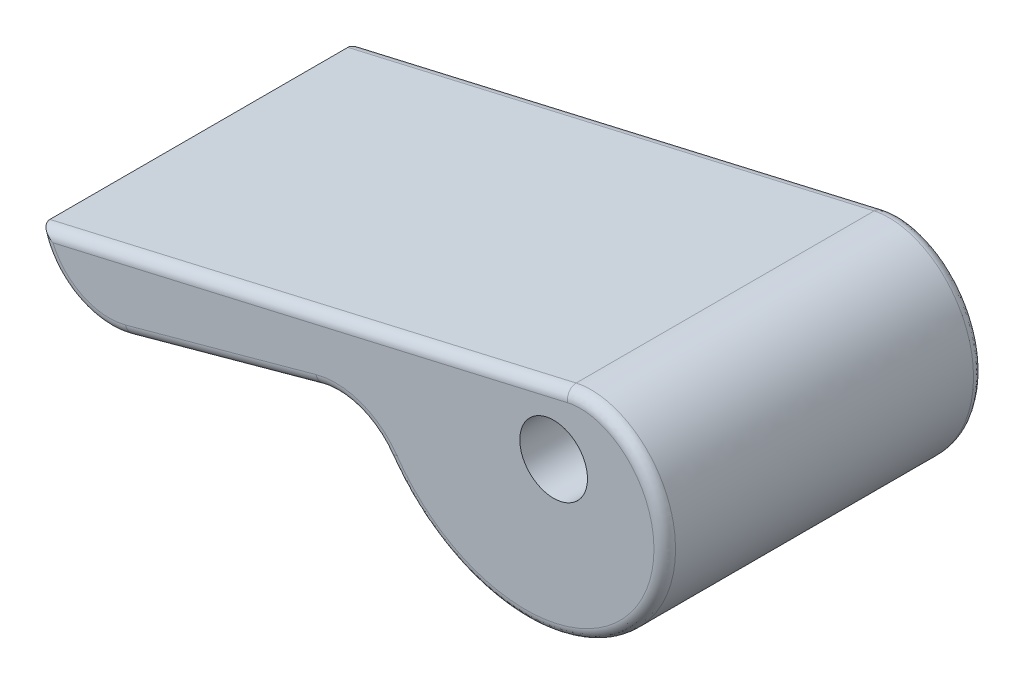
ISO-10303-21;
HEADER;
FILE_DESCRIPTION(('STEP AP214'),'2;1');
FILE_NAME('part.step','',(''),(''),'','','');
FILE_SCHEMA(('AUTOMOTIVE_DESIGN { 1 0 10303 214 1 1 1 1 }'));
ENDSEC;
DATA;
#1=APPLICATION_CONTEXT('core data for automotive mechanical design processes');
#2=APPLICATION_PROTOCOL_DEFINITION('international standard','automotive_design',2000,#1);
#3=PRODUCT_CONTEXT('',#1,'mechanical');
#4=PRODUCT('Part','Part','',(#3));
#5=PRODUCT_RELATED_PRODUCT_CATEGORY('part','',(#4));
#6=PRODUCT_DEFINITION_FORMATION('','',#4);
#7=PRODUCT_DEFINITION_CONTEXT('part definition',#1,'design');
#8=PRODUCT_DEFINITION('design','',#6,#7);
#9=PRODUCT_DEFINITION_SHAPE('','',#8);
#10=(LENGTH_UNIT() NAMED_UNIT(*) SI_UNIT(.MILLI.,.METRE.));
#11=(NAMED_UNIT(*) PLANE_ANGLE_UNIT() SI_UNIT($,.RADIAN.));
#12=(NAMED_UNIT(*) SI_UNIT($,.STERADIAN.) SOLID_ANGLE_UNIT());
#13=UNCERTAINTY_MEASURE_WITH_UNIT(LENGTH_MEASURE(1.E-05),#10,'distance_accuracy_value','');
#14=(GEOMETRIC_REPRESENTATION_CONTEXT(3) GLOBAL_UNCERTAINTY_ASSIGNED_CONTEXT((#13)) GLOBAL_UNIT_ASSIGNED_CONTEXT((#10,
#11,#12)) REPRESENTATION_CONTEXT('',''));
#15=CARTESIAN_POINT('',(0.,0.,0.));
#16=DIRECTION('',(0.,0.,1.));
#17=DIRECTION('',(1.,0.,0.));
#18=AXIS2_PLACEMENT_3D('',#15,#16,#17);
#19=CARTESIAN_POINT('',(-11.7000514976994,-5.70649640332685,11.27125));
#20=CARTESIAN_POINT('',(-11.0599415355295,-6.62660225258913,11.27125));
#21=CARTESIAN_POINT('',(-10.3116332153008,-7.44448262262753,11.27125));
#22=CARTESIAN_POINT('',(-8.66542065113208,-8.83518832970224,11.27125));
#23=CARTESIAN_POINT('',(-7.76770605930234,-9.4079786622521,11.27125));
#24=CARTESIAN_POINT('',(-5.89582883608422,-10.287925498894,11.27125));
#25=CARTESIAN_POINT('',(-4.92185346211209,-10.5950995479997,11.27125));
#26=CARTESIAN_POINT('',(-2.97088396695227,-10.9436938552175,11.27125));
#27=CARTESIAN_POINT('',(-1.99406079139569,-10.9851805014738,11.27125));
#28=CARTESIAN_POINT('',(-0.105680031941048,-10.8214617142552,11.27125));
#29=CARTESIAN_POINT('',(0.805735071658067,-10.6163642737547,11.27125));
#30=CARTESIAN_POINT('',(2.50490718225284,-9.99507349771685,11.27125));
#31=CARTESIAN_POINT('',(3.29255970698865,-9.57901964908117,11.27125));
#32=CARTESIAN_POINT('',(4.69944491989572,-8.58419251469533,11.27125));
#33=CARTESIAN_POINT('',(5.31861739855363,-8.00557808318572,11.27125));
#34=CARTESIAN_POINT('',(6.35990315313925,-6.74226239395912,11.27125));
#35=CARTESIAN_POINT('',(6.7820031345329,-6.05772620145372,11.27125));
#36=CARTESIAN_POINT('',(7.417736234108,-4.64254491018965,11.27125));
#37=CARTESIAN_POINT('',(7.63140189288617,-3.9120579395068,11.27125));
#38=CARTESIAN_POINT('',(7.85579393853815,-2.46339940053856,11.27125));
#39=CARTESIAN_POINT('',(7.86659409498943,-1.74536689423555,11.27125));
#40=CARTESIAN_POINT('',(7.70610206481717,-0.373984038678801,11.27125));
#41=CARTESIAN_POINT('',(7.53491720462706,0.279256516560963,11.27125));
#42=CARTESIAN_POINT('',(7.04387224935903,1.47851684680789,11.27125));
#43=CARTESIAN_POINT('',(6.72414298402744,2.02446363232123,11.27125));
#44=CARTESIAN_POINT('',(5.97838286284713,2.97919436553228,11.27125));
#45=CARTESIAN_POINT('',(5.55249475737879,3.38794648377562,11.27125));
#46=CARTESIAN_POINT('',(4.64159702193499,4.05252851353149,11.27125));
#47=CARTESIAN_POINT('',(4.15672990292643,4.30836867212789,11.27125));
#48=CARTESIAN_POINT('',(3.1755339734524,4.66587408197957,11.27125));
#49=CARTESIAN_POINT('',(2.67933567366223,4.76758914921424,11.27125));
#50=CARTESIAN_POINT('',(1.71947641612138,4.82918436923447,11.27125));
#51=CARTESIAN_POINT('',(1.25592353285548,4.78914825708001,11.27125));
#52=CARTESIAN_POINT('',(0.826999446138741,4.69014692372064,11.27125));
#53=B_SPLINE_CURVE_WITH_KNOTS('',3,(#19,#20,#21,#22,#23,#24,#25,#26,#27,#28,#29,#30,#31,#32,#33,
#34,#35,#36,#37,#38,#39,#40,#41,#42,#43,#44,#45,#46,#47,#48,#49,#50,#51,#52),.UNSPECIFIED.,.F.,
.F.,(4,2,2,2,2,2,2,2,2,2,2,2,2,2,2,2,4),(0.,0.0625,0.125,0.1875,0.25,0.3125,0.375,0.4375,0.5,
0.5625,0.625,0.6875,0.75,0.8125,0.875,0.9375,1.),.UNSPECIFIED.);
#54=DIRECTION('',(0.,0.,-1.));
#55=VECTOR('',#54,1.);
#56=SURFACE_OF_LINEAR_EXTRUSION('',#53,#55);
#57=DIRECTION('',(0.,0.,-1.));
#58=VECTOR('',#57,1.);
#59=CARTESIAN_POINT('',(-11.7000514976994,-5.70649640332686,11.27125));
#60=LINE('',#59,#58);
#61=CARTESIAN_POINT('',(-11.7000514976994,-5.70649640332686,10.50925));
#62=VERTEX_POINT('',#61);
#63=CARTESIAN_POINT('',(-11.7000514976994,-5.70649640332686,-10.50925));
#64=VERTEX_POINT('',#63);
#65=EDGE_CURVE('E208',#62,#64,#60,.T.);
#66=ORIENTED_EDGE('',*,*,#65,.T.);
#67=CARTESIAN_POINT('',(-15.647402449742,1.30179770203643,-11.27125));
#68=CARTESIAN_POINT('',(-16.272920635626,0.866629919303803,-11.27125));
#69=CARTESIAN_POINT('',(-16.272920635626,0.866629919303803,-10.50925));
#70=CARTESIAN_POINT('',(-14.1231127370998,-0.889244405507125,-11.27125));
#71=CARTESIAN_POINT('',(-14.748630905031,-1.32441221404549,-11.27125));
#72=CARTESIAN_POINT('',(-14.748630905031,-1.32441221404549,-10.50925));
#73=CARTESIAN_POINT('',(-12.5988230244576,-3.08028651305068,-11.27125));
#74=CARTESIAN_POINT('',(-13.2243411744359,-3.51545434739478,-11.27125));
#75=CARTESIAN_POINT('',(-13.2243411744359,-3.51545434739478,-10.50925));
#76=CARTESIAN_POINT('',(-11.0745333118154,-5.27132862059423,-11.27125));
#77=CARTESIAN_POINT('',(-11.7000514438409,-5.70649648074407,-11.27125));
#78=CARTESIAN_POINT('',(-11.7000514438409,-5.70649648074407,-10.50925));
#79=CARTESIAN_POINT('',(-10.8828564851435,-5.54685244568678,-11.27125));
#80=CARTESIAN_POINT('',(-11.4962204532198,-5.99947055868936,-11.27125));
#81=CARTESIAN_POINT('',(-11.4962204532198,-5.99947055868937,-10.50925));
#82=CARTESIAN_POINT('',(-10.6796418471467,-5.81437506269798,-11.27125));
#83=CARTESIAN_POINT('',(-11.2801389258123,-6.28394818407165,-11.27125));
#84=CARTESIAN_POINT('',(-11.2801389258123,-6.28394818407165,-10.50925));
#85=CARTESIAN_POINT('',(-10.2513975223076,-6.33146272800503,-11.27125));
#86=CARTESIAN_POINT('',(-10.8246334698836,-6.83396305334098,-11.27125));
#87=CARTESIAN_POINT('',(-10.8246334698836,-6.83396305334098,-10.50925));
#88=CARTESIAN_POINT('',(-10.0263621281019,-6.58102304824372,-11.27125));
#89=CARTESIAN_POINT('',(-10.5852034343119,-7.09949531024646,-11.27125));
#90=CARTESIAN_POINT('',(-10.5852034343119,-7.09949531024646,-10.50925));
#91=CARTESIAN_POINT('',(-9.55540967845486,-7.06052121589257,-11.27125));
#92=CARTESIAN_POINT('',(-10.0838109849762,-7.60998129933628,-11.27125));
#93=CARTESIAN_POINT('',(-10.0838109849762,-7.60998129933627,-10.50925));
#94=CARTESIAN_POINT('',(-9.30945528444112,-7.29042244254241,-11.27125));
#95=CARTESIAN_POINT('',(-9.82180826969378,-7.85489661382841,-11.27125));
#96=CARTESIAN_POINT('',(-9.82180826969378,-7.85489661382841,-10.50925));
#97=CARTESIAN_POINT('',(-8.7984238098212,-7.72785280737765,-11.27125));
#98=CARTESIAN_POINT('',(-9.27711979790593,-8.32113419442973,-11.27125));
#99=CARTESIAN_POINT('',(-9.27711979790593,-8.32113419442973,-10.50925));
#100=CARTESIAN_POINT('',(-8.53334873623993,-7.93538428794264,-11.27125));
#101=CARTESIAN_POINT('',(-8.99443621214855,-8.54245893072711,-11.27125));
#102=CARTESIAN_POINT('',(-8.99443621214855,-8.54245893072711,-10.50925));
#103=CARTESIAN_POINT('',(-7.98973160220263,-8.32361702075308,-11.27125));
#104=CARTESIAN_POINT('',(-8.41459628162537,-8.9565684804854,-11.27125));
#105=CARTESIAN_POINT('',(-8.41459628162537,-8.9565684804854,-10.50925));
#106=CARTESIAN_POINT('',(-7.71142544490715,-8.5046485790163,-11.27125));
#107=CARTESIAN_POINT('',(-8.11769304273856,-9.14970453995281,-11.27125));
#108=CARTESIAN_POINT('',(-8.11769304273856,-9.14970453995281,-10.50925));
#109=CARTESIAN_POINT('',(-7.13993055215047,-8.84152505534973,-11.27125));
#110=CARTESIAN_POINT('',(-7.50755815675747,-9.50935226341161,-11.27125));
#111=CARTESIAN_POINT('',(-7.50755815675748,-9.50935226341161,-10.50925));
#112=CARTESIAN_POINT('',(-6.84674140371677,-8.99736927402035,-11.27125));
#113=CARTESIAN_POINT('',(-7.19432605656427,-9.67586318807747,-11.27125));
#114=CARTESIAN_POINT('',(-7.19432605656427,-9.67586318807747,-10.50925));
#115=CARTESIAN_POINT('',(-6.2478035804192,-9.28182589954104,-11.27125));
#116=CARTESIAN_POINT('',(-6.55406496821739,-9.97994426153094,-11.27125));
#117=CARTESIAN_POINT('',(-6.55406496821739,-9.97994426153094,-10.50925));
#118=CARTESIAN_POINT('',(-5.9420685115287,-9.41046692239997,-11.27125));
#119=CARTESIAN_POINT('',(-6.2270509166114,-10.1175448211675,-11.27125));
#120=CARTESIAN_POINT('',(-6.22705091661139,-10.1175448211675,-10.50925));
#121=CARTESIAN_POINT('',(-5.32017739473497,-9.6394223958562,-11.27125));
#122=CARTESIAN_POINT('',(-5.56171452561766,-10.3625029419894,-11.27125));
#123=CARTESIAN_POINT('',(-5.56171452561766,-10.3625029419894,-10.50925));
#124=CARTESIAN_POINT('',(-5.00402200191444,-9.73973862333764,-11.27125));
#125=CARTESIAN_POINT('',(-5.22339289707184,-10.4698624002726,-11.27125));
#126=CARTESIAN_POINT('',(-5.22339289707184,-10.4698624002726,-10.50925));
#127=CARTESIAN_POINT('',(-4.38219071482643,-9.90580938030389,-11.27125));
#128=CARTESIAN_POINT('',(-4.55736542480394,-10.647729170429,-11.27125));
#129=CARTESIAN_POINT('',(-4.55736542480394,-10.647729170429,-10.50925));
#130=CARTESIAN_POINT('',(-4.0769570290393,-9.97321908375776,-11.27125));
#131=CARTESIAN_POINT('',(-4.23016719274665,-10.7200000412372,-11.27125));
#132=CARTESIAN_POINT('',(-4.23016719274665,-10.7200000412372,-10.50925));
#133=CARTESIAN_POINT('',(-3.46169285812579,-10.0805206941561,-11.27125));
#134=CARTESIAN_POINT('',(-3.57028806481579,-10.835083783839,-11.27125));
#135=CARTESIAN_POINT('',(-3.57028806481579,-10.835083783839,-10.50925));
#136=CARTESIAN_POINT('',(-3.15166249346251,-10.120413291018,-11.27125));
#137=CARTESIAN_POINT('',(-3.23760730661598,-10.8778973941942,-11.27125));
#138=CARTESIAN_POINT('',(-3.23760730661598,-10.8778973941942,-10.50925));
#139=CARTESIAN_POINT('',(-2.52919895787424,-10.172115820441,-11.27125));
#140=CARTESIAN_POINT('',(-2.56941618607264,-10.9334006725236,-11.27125));
#141=CARTESIAN_POINT('',(-2.56941618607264,-10.9334006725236,-10.50925));
#142=CARTESIAN_POINT('',(-2.21676569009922,-10.1839246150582,-11.27125));
#143=CARTESIAN_POINT('',(-2.23390570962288,-10.9460891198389,-11.27125));
#144=CARTESIAN_POINT('',(-2.23390570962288,-10.9460891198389,-10.50925));
#145=CARTESIAN_POINT('',(-1.74838159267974,-10.1801222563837,-11.27125));
#146=CARTESIAN_POINT('',(-1.7305219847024,-10.9420022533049,-11.27125));
#147=CARTESIAN_POINT('',(-1.7305219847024,-10.9420022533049,-10.50925));
#148=CARTESIAN_POINT('',(-1.59228086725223,-10.175267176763,-11.27125));
#149=CARTESIAN_POINT('',(-1.56268944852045,-10.9367848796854,-11.27125));
#150=CARTESIAN_POINT('',(-1.56268944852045,-10.9367848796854,-10.50925));
#151=CARTESIAN_POINT('',(-1.28047499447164,-10.1582951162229,-11.27125));
#152=CARTESIAN_POINT('',(-1.22725554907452,-10.9185258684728,-11.27125));
#153=CARTESIAN_POINT('',(-1.22725554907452,-10.9185258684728,-10.50925));
#154=CARTESIAN_POINT('',(-1.12476983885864,-10.1461782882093,-11.27125));
#155=CARTESIAN_POINT('',(-1.05965418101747,-10.9054843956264,-11.27125));
#156=CARTESIAN_POINT('',(-1.05965418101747,-10.9054843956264,-10.50925));
#157=CARTESIAN_POINT('',(-0.679152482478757,-10.1009192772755,-11.27125));
#158=CARTESIAN_POINT('',(-0.579920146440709,-10.8567618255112,-11.27125));
#159=CARTESIAN_POINT('',(-0.579920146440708,-10.8567618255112,-10.50925));
#160=CARTESIAN_POINT('',(-0.390118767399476,-10.0586562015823,-11.27125));
#161=CARTESIAN_POINT('',(-0.268671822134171,-10.8112552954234,-11.27125));
#162=CARTESIAN_POINT('',(-0.268671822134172,-10.8112552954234,-10.50925));
#163=CARTESIAN_POINT('',(0.183063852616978,-9.94863667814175,-11.27125));
#164=CARTESIAN_POINT('',(0.348888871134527,-10.6927175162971,-11.27125));
#165=CARTESIAN_POINT('',(0.348888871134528,-10.6927175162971,-10.50925));
#166=CARTESIAN_POINT('',(0.46721291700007,-9.88088106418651,-11.27125));
#167=CARTESIAN_POINT('',(0.655201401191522,-10.6196871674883,-11.27125));
#168=CARTESIAN_POINT('',(0.655201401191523,-10.6196871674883,-10.50925));
#169=CARTESIAN_POINT('',(0.887857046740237,-9.76020959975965,-11.27125));
#170=CARTESIAN_POINT('',(1.10905204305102,-10.4894897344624,-11.27125));
#171=CARTESIAN_POINT('',(1.10905204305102,-10.4894897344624,-10.50925));
#172=CARTESIAN_POINT('',(1.02713670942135,-9.71681476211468,-11.27125));
#173=CARTESIAN_POINT('',(1.25939367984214,-10.4426507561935,-11.27125));
#174=CARTESIAN_POINT('',(1.25939367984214,-10.4426507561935,-10.50925));
#175=CARTESIAN_POINT('',(1.30355238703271,-9.62366871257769,-11.27125));
#176=CARTESIAN_POINT('',(1.55794134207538,-10.3420459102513,-11.27125));
#177=CARTESIAN_POINT('',(1.55794134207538,-10.3420459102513,-10.50925));
#178=CARTESIAN_POINT('',(1.44068840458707,-9.5739175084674,-11.27125));
#179=CARTESIAN_POINT('',(1.70614737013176,-10.2882800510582,-11.27125));
#180=CARTESIAN_POINT('',(1.70614737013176,-10.2882800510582,-10.50925));
#181=CARTESIAN_POINT('',(1.84838568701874,-9.41519551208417,-11.27125));
#182=CARTESIAN_POINT('',(2.14682162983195,-10.1167211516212,-11.27125));
#183=CARTESIAN_POINT('',(2.14682162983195,-10.1167211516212,-10.50925));
#184=CARTESIAN_POINT('',(2.11532710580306,-9.29673033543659,-11.27125));
#185=CARTESIAN_POINT('',(2.43544425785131,-9.98863870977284,-11.27125));
#186=CARTESIAN_POINT('',(2.43544425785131,-9.98863870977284,-10.50925));
#187=CARTESIAN_POINT('',(2.61906263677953,-9.04422708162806,-11.27125));
#188=CARTESIAN_POINT('',(2.98043469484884,-9.71545875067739,-11.27125));
#189=CARTESIAN_POINT('',(2.98043469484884,-9.71545875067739,-10.50925));
#190=CARTESIAN_POINT('',(2.85667077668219,-8.91180415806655,-11.27125));
#191=CARTESIAN_POINT('',(3.2376593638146,-9.57211965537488,-11.27125));
#192=CARTESIAN_POINT('',(3.2376593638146,-9.57211965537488,-10.50925));
#193=CARTESIAN_POINT('',(3.31910711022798,-8.62621421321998,-11.27125));
#194=CARTESIAN_POINT('',(3.73885093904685,-9.26258819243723,-11.27125));
#195=CARTESIAN_POINT('',(3.73885093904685,-9.26258819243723,-10.50925));
#196=CARTESIAN_POINT('',(3.54393581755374,-8.47304802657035,-11.27125));
#197=CARTESIAN_POINT('',(3.98281837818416,-9.09639674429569,-11.27125));
#198=CARTESIAN_POINT('',(3.98281837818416,-9.09639674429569,-10.50925));
#199=CARTESIAN_POINT('',(3.97855342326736,-8.14679237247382,-11.27125));
#200=CARTESIAN_POINT('',(4.4546534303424,-8.74220651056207,-11.27125));
#201=CARTESIAN_POINT('',(4.4546534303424,-8.74220651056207,-10.50925));
#202=CARTESIAN_POINT('',(4.18834630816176,-7.97370821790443,-11.27125));
#203=CARTESIAN_POINT('',(4.68252531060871,-8.55421354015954,-11.27125));
#204=CARTESIAN_POINT('',(4.68252531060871,-8.55421354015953,-10.50925));
#205=CARTESIAN_POINT('',(4.59098825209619,-7.6088356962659,-11.27125));
#206=CARTESIAN_POINT('',(5.12017036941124,-8.15762573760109,-11.27125));
#207=CARTESIAN_POINT('',(5.12017036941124,-8.15762573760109,-10.50925));
#208=CARTESIAN_POINT('',(4.78383845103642,-7.417048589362,-11.27125));
#209=CARTESIAN_POINT('',(5.3299447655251,-7.94903229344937,-11.27125));
#210=CARTESIAN_POINT('',(5.32994476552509,-7.94903229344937,-10.50925));
#211=CARTESIAN_POINT('',(5.13691713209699,-7.03071618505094,-11.27125));
#212=CARTESIAN_POINT('',(5.71451986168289,-7.52822664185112,-11.27125));
#213=CARTESIAN_POINT('',(5.71451986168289,-7.52822664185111,-10.50925));
#214=CARTESIAN_POINT('',(5.29850149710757,-6.83740978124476,-11.27125));
#215=CARTESIAN_POINT('',(5.8907578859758,-7.31740738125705,-11.27125));
#216=CARTESIAN_POINT('',(5.8907578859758,-7.31740738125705,-10.50925));
#217=CARTESIAN_POINT('',(5.60355535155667,-6.43698750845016,-11.27125));
#218=CARTESIAN_POINT('',(6.22362298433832,-6.88048677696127,-11.27125));
#219=CARTESIAN_POINT('',(6.22362298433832,-6.88048677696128,-10.50925));
#220=CARTESIAN_POINT('',(5.74702547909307,-6.22987212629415,-11.27125));
#221=CARTESIAN_POINT('',(6.38025074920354,-6.65438597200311,-11.27125));
#222=CARTESIAN_POINT('',(6.38025074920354,-6.65438597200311,-10.50925));
#223=CARTESIAN_POINT('',(6.01437471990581,-5.80344423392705,-11.27125));
#224=CARTESIAN_POINT('',(6.67236642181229,-6.18845786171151,-11.27125));
#225=CARTESIAN_POINT('',(6.67236642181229,-6.18845786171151,-10.50925));
#226=CARTESIAN_POINT('',(6.1382603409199,-5.5841358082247,-11.27125));
#227=CARTESIAN_POINT('',(6.80786135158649,-5.94863515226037,-11.27125));
#228=CARTESIAN_POINT('',(6.80786135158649,-5.94863515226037,-10.50925));
#229=CARTESIAN_POINT('',(6.36481249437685,-5.13480866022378,-11.27125));
#230=CARTESIAN_POINT('',(7.05597992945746,-5.45652009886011,-11.27125));
#231=CARTESIAN_POINT('',(7.05597992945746,-5.45652009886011,-10.50925));
#232=CARTESIAN_POINT('',(6.46748076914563,-4.90479081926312,-11.27125));
#233=CARTESIAN_POINT('',(7.16860545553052,-5.2042287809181,-11.27125));
#234=CARTESIAN_POINT('',(7.16860545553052,-5.2042287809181,-10.50925));
#235=CARTESIAN_POINT('',(6.6426754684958,-4.45511225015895,-11.27125));
#236=CARTESIAN_POINT('',(7.36088300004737,-4.71071934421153,-11.27125));
#237=CARTESIAN_POINT('',(7.36088300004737,-4.71071934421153,-10.50925));
#238=CARTESIAN_POINT('',(6.71698032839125,-4.23614302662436,-11.27125));
#239=CARTESIAN_POINT('',(7.44247843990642,-4.47028314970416,-11.27125));
#240=CARTESIAN_POINT('',(7.44247843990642,-4.47028314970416,-10.50925));
#241=CARTESIAN_POINT('',(6.84559733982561,-3.79239772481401,-11.27125));
#242=CARTESIAN_POINT('',(7.58385580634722,-3.98251304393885,-11.27125));
#243=CARTESIAN_POINT('',(7.58385580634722,-3.98251304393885,-10.50925));
#244=CARTESIAN_POINT('',(6.8999103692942,-3.56762190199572,-11.27125));
#245=CARTESIAN_POINT('',(7.64363869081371,-3.73517943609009,-11.27125));
#246=CARTESIAN_POINT('',(7.64363869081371,-3.73517943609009,-10.50925));
#247=CARTESIAN_POINT('',(6.98741220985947,-3.11405253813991,-11.27125));
#248=CARTESIAN_POINT('',(7.7400730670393,-3.23527767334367,-11.27125));
#249=CARTESIAN_POINT('',(7.7400730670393,-3.23527767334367,-10.50925));
#250=CARTESIAN_POINT('',(7.02060772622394,-2.88526029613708,-11.27125));
#251=CARTESIAN_POINT('',(7.77673190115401,-2.98271120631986,-11.27125));
#252=CARTESIAN_POINT('',(7.77673190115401,-2.98271120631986,-10.50925));
#253=CARTESIAN_POINT('',(7.06511572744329,-2.42555626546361,-11.27125));
#254=CARTESIAN_POINT('',(7.82590407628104,-2.47491269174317,-11.27125));
#255=CARTESIAN_POINT('',(7.82590407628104,-2.47491269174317,-10.50925));
#256=CARTESIAN_POINT('',(7.07643001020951,-2.19464465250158,-11.27125));
#257=CARTESIAN_POINT('',(7.83841940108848,-2.2196808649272,-11.27125));
#258=CARTESIAN_POINT('',(7.83841940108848,-2.2196808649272,-10.50925));
#259=CARTESIAN_POINT('',(7.07663766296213,-1.75270102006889,-11.27125));
#260=CARTESIAN_POINT('',(7.83864720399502,-1.73049203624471,-11.27125));
#261=CARTESIAN_POINT('',(7.83864720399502,-1.73049203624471,-10.50925));
#262=CARTESIAN_POINT('',(7.0673776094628,-1.54166917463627,-11.27125));
#263=CARTESIAN_POINT('',(7.82840244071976,-1.49659537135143,-11.27125));
#264=CARTESIAN_POINT('',(7.82840244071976,-1.49659537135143,-10.50925));
#265=CARTESIAN_POINT('',(7.02955523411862,-1.12132429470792,-11.27125));
#266=CARTESIAN_POINT('',(7.78640663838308,-1.02991464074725,-11.27125));
#267=CARTESIAN_POINT('',(7.78640663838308,-1.02991464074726,-10.50925));
#268=CARTESIAN_POINT('',(7.00099375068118,-0.912011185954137,-11.27125));
#269=CARTESIAN_POINT('',(7.75465653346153,-0.797130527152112,-11.27125));
#270=CARTESIAN_POINT('',(7.75465653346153,-0.797130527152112,-10.50925));
#271=CARTESIAN_POINT('',(6.92441256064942,-0.497066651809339,-11.27125));
#272=CARTESIAN_POINT('',(7.6694317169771,-0.335309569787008,-11.27125));
#273=CARTESIAN_POINT('',(7.6694317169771,-0.335309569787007,-10.50925));
#274=CARTESIAN_POINT('',(6.87640085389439,-0.291433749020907,-11.27125));
#275=CARTESIAN_POINT('',(7.61596593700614,-0.106271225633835,-11.27125));
#276=CARTESIAN_POINT('',(7.61596593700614,-0.106271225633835,-10.50925));
#277=CARTESIAN_POINT('',(6.76088972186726,0.114328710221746,-11.27125));
#278=CARTESIAN_POINT('',(7.48709173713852,0.346422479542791,-11.27125));
#279=CARTESIAN_POINT('',(7.48709173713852,0.34642247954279,-10.50925));
#280=CARTESIAN_POINT('',(6.69339238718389,0.314458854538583,-11.27125));
#281=CARTESIAN_POINT('',(7.41168567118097,0.570078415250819,-11.27125));
#282=CARTESIAN_POINT('',(7.41168567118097,0.570078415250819,-10.50925));
#283=CARTESIAN_POINT('',(6.58122464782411,0.599327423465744,-11.27125));
#284=CARTESIAN_POINT('',(7.28605640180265,0.889130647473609,-11.27125));
#285=CARTESIAN_POINT('',(7.28605640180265,0.889130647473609,-10.50925));
#286=CARTESIAN_POINT('',(6.54432300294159,0.687183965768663,-11.27125));
#287=CARTESIAN_POINT('',(7.24468694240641,0.987629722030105,-11.27125));
#288=CARTESIAN_POINT('',(7.24468694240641,0.987629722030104,-10.50925));
#289=CARTESIAN_POINT('',(6.46655683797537,0.861124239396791,-11.27125));
#290=CARTESIAN_POINT('',(7.1574698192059,1.18271106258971,-11.27125));
#291=CARTESIAN_POINT('',(7.1574698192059,1.18271106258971,-10.50925));
#292=CARTESIAN_POINT('',(6.42569241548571,0.947208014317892,-11.27125));
#293=CARTESIAN_POINT('',(7.11162226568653,1.27929337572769,-11.27125));
#294=CARTESIAN_POINT('',(7.11162226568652,1.27929337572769,-10.50925));
#295=CARTESIAN_POINT('',(6.2972308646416,1.20248996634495,-11.27125));
#296=CARTESIAN_POINT('',(6.96740662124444,1.5658829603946,-11.27125));
#297=CARTESIAN_POINT('',(6.96740662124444,1.56588296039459,-10.50925));
#298=CARTESIAN_POINT('',(6.20374530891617,1.36877003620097,-11.27125));
#299=CARTESIAN_POINT('',(6.8623429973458,1.75279029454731,-11.27125));
#300=CARTESIAN_POINT('',(6.8623429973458,1.75279029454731,-10.50925));
#301=CARTESIAN_POINT('',(6.00153442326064,1.69170936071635,-11.27125));
#302=CARTESIAN_POINT('',(6.63461469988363,2.11648081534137,-11.27125));
#303=CARTESIAN_POINT('',(6.63461469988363,2.11648081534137,-10.50925));
#304=CARTESIAN_POINT('',(5.89281653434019,1.84837325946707,-11.27125));
#305=CARTESIAN_POINT('',(6.51195861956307,2.29326888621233,-11.27125));
#306=CARTESIAN_POINT('',(6.51195861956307,2.29326888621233,-10.50925));
#307=CARTESIAN_POINT('',(5.71863141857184,2.07475302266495,-11.27125));
#308=CARTESIAN_POINT('',(6.31494771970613,2.54931103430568,-11.27125));
#309=CARTESIAN_POINT('',(6.31494771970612,2.54931103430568,-10.50925));
#310=CARTESIAN_POINT('',(5.65871234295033,2.14878330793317,-11.27125));
#311=CARTESIAN_POINT('',(6.24709948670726,2.63314234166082,-11.27125));
#312=CARTESIAN_POINT('',(6.24709948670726,2.63314234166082,-10.50925));
#313=CARTESIAN_POINT('',(5.53526550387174,2.29376865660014,-11.27125));
#314=CARTESIAN_POINT('',(6.10724106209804,2.79740476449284,-11.27125));
#315=CARTESIAN_POINT('',(6.10724106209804,2.79740476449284,-10.50925));
#316=CARTESIAN_POINT('',(5.47173770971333,2.36472369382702,-11.27125));
#317=CARTESIAN_POINT('',(6.03523083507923,2.87783585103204,-11.27125));
#318=CARTESIAN_POINT('',(6.03523083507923,2.87783585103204,-10.50925));
#319=CARTESIAN_POINT('',(5.2899457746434,2.55774228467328,-11.27125));
#320=CARTESIAN_POINT('',(5.82898063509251,3.09682227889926,-11.27125));
#321=CARTESIAN_POINT('',(5.82898063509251,3.09682227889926,-10.50925));
#322=CARTESIAN_POINT('',(5.1678314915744,2.67624131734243,-11.27125));
#323=CARTESIAN_POINT('',(5.69023146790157,3.23148623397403,-11.27125));
#324=CARTESIAN_POINT('',(5.69023146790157,3.23148623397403,-10.50925));
#325=CARTESIAN_POINT('',(4.97687665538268,2.84508150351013,-11.27125));
#326=CARTESIAN_POINT('',(5.47278711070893,3.42374916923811,-11.27125));
#327=CARTESIAN_POINT('',(5.47278711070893,3.42374916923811,-10.50925));
#328=CARTESIAN_POINT('',(4.91191973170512,2.89988274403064,-11.27125));
#329=CARTESIAN_POINT('',(5.3987429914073,3.48622140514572,-11.27125));
#330=CARTESIAN_POINT('',(5.3987429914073,3.48622140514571,-10.50925));
#331=CARTESIAN_POINT('',(4.77948334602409,3.00635153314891,-11.27125));
#332=CARTESIAN_POINT('',(5.24753963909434,3.60777591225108,-11.27125));
#333=CARTESIAN_POINT('',(5.24753963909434,3.60777591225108,-10.50925));
#334=CARTESIAN_POINT('',(4.712003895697,3.05801909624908,-11.27125));
#335=CARTESIAN_POINT('',(5.1703804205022,3.66685819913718,-11.27125));
#336=CARTESIAN_POINT('',(5.1703804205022,3.66685819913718,-10.50925));
#337=CARTESIAN_POINT('',(4.50593589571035,3.20802451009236,-11.27125));
#338=CARTESIAN_POINT('',(4.93453844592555,3.83853847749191,-11.27125));
#339=CARTESIAN_POINT('',(4.93453844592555,3.83853847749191,-10.50925));
#340=CARTESIAN_POINT('',(4.36368316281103,3.30139573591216,-11.27125));
#341=CARTESIAN_POINT('',(4.77145199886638,3.94560485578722,-11.27125));
#342=CARTESIAN_POINT('',(4.77145199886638,3.94560485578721,-10.50925));
#343=CARTESIAN_POINT('',(4.07061446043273,3.47356404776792,-11.27125));
#344=CARTESIAN_POINT('',(4.43479975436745,4.14338035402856,-11.27125));
#345=CARTESIAN_POINT('',(4.43479975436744,4.14338035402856,-10.50925));
#346=CARTESIAN_POINT('',(3.91979987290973,3.55236347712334,-11.27125));
#347=CARTESIAN_POINT('',(4.26123564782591,4.23409210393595,-11.27125));
#348=CARTESIAN_POINT('',(4.26123564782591,4.23409210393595,-10.50925));
#349=CARTESIAN_POINT('',(3.6972045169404,3.65442693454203,-11.27125));
#350=CARTESIAN_POINT('',(4.00426956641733,4.35191460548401,-11.27125));
#351=CARTESIAN_POINT('',(4.00426956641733,4.35191460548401,-10.50925));
#352=CARTESIAN_POINT('',(3.62832596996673,3.68412812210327,-11.27125));
#353=CARTESIAN_POINT('',(3.92465076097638,4.38625142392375,-11.27125));
#354=CARTESIAN_POINT('',(3.92465076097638,4.38625142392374,-10.50925));
#355=CARTESIAN_POINT('',(3.48925955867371,3.7402858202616,-11.27125));
#356=CARTESIAN_POINT('',(3.76360334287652,4.45128437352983,-11.27125));
#357=CARTESIAN_POINT('',(3.76360334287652,4.45128437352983,-10.50925));
#358=CARTESIAN_POINT('',(3.41907173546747,3.76674243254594,-11.27125));
#359=CARTESIAN_POINT('',(3.68217478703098,4.48198061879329,-11.27125));
#360=CARTESIAN_POINT('',(3.68217478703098,4.48198061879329,-10.50925));
#361=CARTESIAN_POINT('',(3.20673558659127,3.84105319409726,-11.27125));
#362=CARTESIAN_POINT('',(3.43560856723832,4.56827271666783,-11.27125));
#363=CARTESIAN_POINT('',(3.43560856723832,4.56827271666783,-10.50925));
#364=CARTESIAN_POINT('',(3.06278495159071,3.88386191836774,-11.27125));
#365=CARTESIAN_POINT('',(3.26815607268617,4.6180877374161,-11.27125));
#366=CARTESIAN_POINT('',(3.26815607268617,4.6180877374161,-10.50925));
#367=CARTESIAN_POINT('',(2.77178490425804,3.95508464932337,-11.27125));
#368=CARTESIAN_POINT('',(2.92879826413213,4.70114714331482,-11.27125));
#369=CARTESIAN_POINT('',(2.92879826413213,4.70114714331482,-10.50925));
#370=CARTESIAN_POINT('',(2.62474570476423,3.98354009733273,-11.27125));
#371=CARTESIAN_POINT('',(2.75690729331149,4.73443922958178,-11.27125));
#372=CARTESIAN_POINT('',(2.75690729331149,4.73443922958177,-10.50925));
#373=CARTESIAN_POINT('',(2.40265833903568,4.01488685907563,-11.27125));
#374=CARTESIAN_POINT('',(2.49631560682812,4.77122028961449,-11.27125));
#375=CARTESIAN_POINT('',(2.49631560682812,4.77122028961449,-10.50925));
#376=CARTESIAN_POINT('',(2.32837822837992,4.02344623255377,-11.27125));
#377=CARTESIAN_POINT('',(2.40899696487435,4.7812876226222,-11.27125));
#378=CARTESIAN_POINT('',(2.40899696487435,4.7812876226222,-10.50925));
#379=CARTESIAN_POINT('',(2.17947486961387,4.03665429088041,-11.27125));
#380=CARTESIAN_POINT('',(2.23354989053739,4.7968489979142,-11.27125));
#381=CARTESIAN_POINT('',(2.23354989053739,4.7968489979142,-10.50925));
#382=CARTESIAN_POINT('',(2.10485167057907,4.04130351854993,-11.27125));
#383=CARTESIAN_POINT('',(2.14542157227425,4.80234367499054,-11.27125));
#384=CARTESIAN_POINT('',(2.14542157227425,4.80234367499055,-10.50925));
#385=CARTESIAN_POINT('',(1.94367572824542,4.04701052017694,-11.27125));
#386=CARTESIAN_POINT('',(1.95485827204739,4.80909308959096,-11.27125));
#387=CARTESIAN_POINT('',(1.95485827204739,4.80909308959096,-10.50925));
#388=CARTESIAN_POINT('',(1.85709798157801,4.04738609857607,-11.27125));
#389=CARTESIAN_POINT('',(1.85235935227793,4.80954230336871,-11.27125));
#390=CARTESIAN_POINT('',(1.85235935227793,4.80954230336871,-10.50925));
#391=CARTESIAN_POINT('',(1.68412504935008,4.04265189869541,-11.27125));
#392=CARTESIAN_POINT('',(1.64718190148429,4.80392558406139,-11.27125));
#393=CARTESIAN_POINT('',(1.64718190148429,4.80392558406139,-10.50925));
#394=CARTESIAN_POINT('',(1.59772980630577,4.03754423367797,-11.27125));
#395=CARTESIAN_POINT('',(1.54450345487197,4.79786216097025,-11.27125));
#396=CARTESIAN_POINT('',(1.54450345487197,4.79786216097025,-10.50925));
#397=CARTESIAN_POINT('',(1.42529385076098,4.02170550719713,-11.27125));
#398=CARTESIAN_POINT('',(1.33908440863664,4.77899545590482,-11.27125));
#399=CARTESIAN_POINT('',(1.33908440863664,4.77899545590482,-10.50925));
#400=CARTESIAN_POINT('',(1.33925405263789,4.01096437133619,-11.27125));
#401=CARTESIAN_POINT('',(1.23634402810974,4.76618009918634,-11.27125));
#402=CARTESIAN_POINT('',(1.23634402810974,4.76618009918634,-10.50925));
#403=CARTESIAN_POINT('',(1.16804422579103,3.98369607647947,-11.27125));
#404=CARTESIAN_POINT('',(1.0312667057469,4.73351386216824,-11.27125));
#405=CARTESIAN_POINT('',(1.0312667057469,4.73351386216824,-10.50925));
#406=CARTESIAN_POINT('',(1.08287476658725,3.96716535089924,-11.27125));
#407=CARTESIAN_POINT('',(0.928930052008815,4.71365864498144,-11.27125));
#408=CARTESIAN_POINT('',(0.928930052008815,4.71365864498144,-10.50925));
#409=CARTESIAN_POINT('',(0.998373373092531,3.94766798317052,-11.27125));
#410=CARTESIAN_POINT('',(0.826999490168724,4.69014693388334,-11.27125));
#411=CARTESIAN_POINT('',(0.826999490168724,4.69014693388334,-10.50925));
#412=CARTESIAN_POINT('',(-1.60235456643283,3.34738569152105,-11.27125));
#413=CARTESIAN_POINT('',(-1.77372846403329,4.08986463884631,-11.27125));
#414=CARTESIAN_POINT('',(-1.77372846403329,4.08986463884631,-10.50925));
#415=CARTESIAN_POINT('',(-4.20308250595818,2.74710339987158,-11.27125));
#416=CARTESIAN_POINT('',(-4.37445641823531,3.48958234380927,-11.27125));
#417=CARTESIAN_POINT('',(-4.37445641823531,3.48958234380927,-10.50925));
#418=CARTESIAN_POINT('',(-6.80381044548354,2.14682110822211,-11.27125));
#419=CARTESIAN_POINT('',(-6.97518437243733,2.88930004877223,-11.27125));
#420=CARTESIAN_POINT('',(-6.97518437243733,2.88930004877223,-10.50925));
#421=(BOUNDED_SURFACE() B_SPLINE_SURFACE(3,2,((#67,#68,#69),(#70,#71,#72),(#73,#74,#75),(#76,
#77,#78),(#79,#80,#81),(#82,#83,#84),(#85,#86,#87),(#88,#89,#90),(#91,#92,#93),(#94,#95,#96),
(#97,#98,#99),(#100,#101,#102),(#103,#104,#105),(#106,#107,#108),(#109,#110,#111),(#112,#113,
#114),(#115,#116,#117),(#118,#119,#120),(#121,#122,#123),(#124,#125,#126),(#127,#128,#129),
(#130,#131,#132),(#133,#134,#135),(#136,#137,#138),(#139,#140,#141),(#142,#143,#144),(#145,#146,
#147),(#148,#149,#150),(#151,#152,#153),(#154,#155,#156),(#157,#158,#159),(#160,#161,#162),
(#163,#164,#165),(#166,#167,#168),(#169,#170,#171),(#172,#173,#174),(#175,#176,#177),(#178,#179,
#180),(#181,#182,#183),(#184,#185,#186),(#187,#188,#189),(#190,#191,#192),(#193,#194,#195),
(#196,#197,#198),(#199,#200,#201),(#202,#203,#204),(#205,#206,#207),(#208,#209,#210),(#211,#212,
#213),(#214,#215,#216),(#217,#218,#219),(#220,#221,#222),(#223,#224,#225),(#226,#227,#228),
(#229,#230,#231),(#232,#233,#234),(#235,#236,#237),(#238,#239,#240),(#241,#242,#243),(#244,#245,
#246),(#247,#248,#249),(#250,#251,#252),(#253,#254,#255),(#256,#257,#258),(#259,#260,#261),
(#262,#263,#264),(#265,#266,#267),(#268,#269,#270),(#271,#272,#273),(#274,#275,#276),(#277,#278,
#279),(#280,#281,#282),(#283,#284,#285),(#286,#287,#288),(#289,#290,#291),(#292,#293,#294),
(#295,#296,#297),(#298,#299,#300),(#301,#302,#303),(#304,#305,#306),(#307,#308,#309),(#310,#311,
#312),(#313,#314,#315),(#316,#317,#318),(#319,#320,#321),(#322,#323,#324),(#325,#326,#327),
(#328,#329,#330),(#331,#332,#333),(#334,#335,#336),(#337,#338,#339),(#340,#341,#342),(#343,#344,
#345),(#346,#347,#348),(#349,#350,#351),(#352,#353,#354),(#355,#356,#357),(#358,#359,#360),
(#361,#362,#363),(#364,#365,#366),(#367,#368,#369),(#370,#371,#372),(#373,#374,#375),(#376,#377,
#378),(#379,#380,#381),(#382,#383,#384),(#385,#386,#387),(#388,#389,#390),(#391,#392,#393),
(#394,#395,#396),(#397,#398,#399),(#400,#401,#402),(#403,#404,#405),(#406,#407,#408),(#409,#410,
#411),(#412,#413,#414),(#415,#416,#417),(#418,#419,#420)),.UNSPECIFIED.,.F.,.F.,
.F.) B_SPLINE_SURFACE_WITH_KNOTS((4,3,2,2,2,2,2,2,2,2,2,2,2,2,2,2,2,2,2,2,2,2,2,2,2,2,2,2,2,2,2,
2,2,2,2,2,2,2,2,2,2,2,2,2,2,2,2,2,2,2,2,2,2,2,2,2,3,4),(3,3),(0.,8.00731676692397,
9.01397262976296,10.0208925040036,11.0296489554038,12.0382996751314,13.0330515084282,
14.0278309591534,15.0215587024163,16.0152240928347,16.9517732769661,17.8882989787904,
18.8248626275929,19.2932465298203,19.7616205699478,20.6367434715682,21.5118377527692,
21.9493519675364,22.3868656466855,23.261610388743,24.0766404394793,24.8916377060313,
25.7064180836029,26.5211436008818,27.2759845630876,28.0307989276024,28.7853619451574,
29.5398629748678,30.2326565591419,30.9254197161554,31.6179627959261,32.3104489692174,
32.9433117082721,33.5761469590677,34.2087221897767,34.8412295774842,35.1270215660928,
35.4128065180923,35.9842118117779,36.5553389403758,36.8409547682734,37.1265730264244,
37.6362140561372,37.8910943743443,38.1459735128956,38.655593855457,39.165132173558,
39.3900922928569,39.6150453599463,40.0648540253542,40.5133564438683,40.7375851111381,
40.9617826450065,41.221345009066,41.4808073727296,41.7407353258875,42.0008236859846,
50.0081404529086),(0.,1.),
.UNSPECIFIED.) GEOMETRIC_REPRESENTATION_ITEM() RATIONAL_B_SPLINE_SURFACE(((1.,0.707106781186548,
1.),(1.,0.707106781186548,1.),(1.,0.707106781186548,1.),(1.,0.707106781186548,1.),(1.,
0.707106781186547,1.),(1.,0.707106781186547,1.),(1.,0.707106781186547,1.),(1.,0.707106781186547,
1.),(1.,0.707106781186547,1.),(1.,0.707106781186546,1.),(1.,0.707106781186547,1.),(1.,
0.707106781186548,1.),(1.,0.707106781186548,1.),(1.,0.707106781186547,1.),(1.,0.707106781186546,
1.),(1.,0.707106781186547,1.),(1.,0.707106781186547,1.),(1.,0.707106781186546,1.),(1.,
0.707106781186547,1.),(1.,0.707106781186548,1.),(1.,0.707106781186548,1.),(1.,0.707106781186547,
1.),(1.,0.707106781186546,1.),(1.,0.707106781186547,1.),(1.,0.707106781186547,1.),(1.,
0.707106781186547,1.),(1.,0.707106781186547,1.),(1.,0.707106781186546,1.),(1.,0.707106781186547,
1.),(1.,0.707106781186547,1.),(1.,0.707106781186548,1.),(1.,0.707106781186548,1.),(1.,
0.707106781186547,1.),(1.,0.707106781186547,1.),(1.,0.707106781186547,1.),(1.,0.707106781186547,
1.),(1.,0.707106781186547,1.),(1.,0.707106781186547,1.),(1.,0.707106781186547,1.),(1.,
0.707106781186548,1.),(1.,0.707106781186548,1.),(1.,0.707106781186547,1.),(1.,0.707106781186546,
1.),(1.,0.707106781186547,1.),(1.,0.707106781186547,1.),(1.,0.707106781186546,1.),(1.,
0.707106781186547,1.),(1.,0.707106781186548,1.),(1.,0.707106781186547,1.),(1.,0.707106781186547,
1.),(1.,0.707106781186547,1.),(1.,0.707106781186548,1.),(1.,0.707106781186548,1.),(1.,
0.707106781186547,1.),(1.,0.707106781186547,1.),(1.,0.707106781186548,1.),(1.,0.707106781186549,
1.),(1.,0.707106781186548,1.),(1.,0.707106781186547,1.),(1.,0.707106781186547,1.),(1.,
0.707106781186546,1.),(1.,0.707106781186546,1.),(1.,0.707106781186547,1.),(1.,0.707106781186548,
1.),(1.,0.707106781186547,1.),(1.,0.707106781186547,1.),(1.,0.707106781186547,1.),(1.,
0.707106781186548,1.),(1.,0.707106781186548,1.),(1.,0.707106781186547,1.),(1.,0.707106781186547,
1.),(1.,0.707106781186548,1.),(1.,0.707106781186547,1.),(1.,0.707106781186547,1.),(1.,
0.707106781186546,1.),(1.,0.707106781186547,1.),(1.,0.707106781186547,1.),(1.,0.707106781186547,
1.),(1.,0.707106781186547,1.),(1.,0.707106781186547,1.),(1.,0.707106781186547,1.),(1.,
0.707106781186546,1.),(1.,0.707106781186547,1.),(1.,0.707106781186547,1.),(1.,0.707106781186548,
1.),(1.,0.707106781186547,1.),(1.,0.707106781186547,1.),(1.,0.707106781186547,1.),(1.,
0.707106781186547,1.),(1.,0.707106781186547,1.),(1.,0.707106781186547,1.),(1.,0.707106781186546,
1.),(1.,0.707106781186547,1.),(1.,0.707106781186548,1.),(1.,0.707106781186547,1.),(1.,
0.707106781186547,1.),(1.,0.707106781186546,1.),(1.,0.707106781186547,1.),(1.,0.707106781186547,
1.),(1.,0.707106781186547,1.),(1.,0.707106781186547,1.),(1.,0.707106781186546,1.),(1.,
0.707106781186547,1.),(1.,0.707106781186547,1.),(1.,0.707106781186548,1.),(1.,0.707106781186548,
1.),(1.,0.707106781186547,1.),(1.,0.707106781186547,1.),(1.,0.707106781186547,1.),(1.,
0.707106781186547,1.),(1.,0.707106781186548,1.),(1.,0.707106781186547,1.),(1.,0.707106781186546,
1.),(1.,0.707106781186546,1.),(1.,0.707106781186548,1.),(1.,0.707106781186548,1.),(1.,
0.707106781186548,1.),(1.,0.707106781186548,1.))) REPRESENTATION_ITEM('') SURFACE());
#422=CARTESIAN_POINT('',(-16.272920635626,0.866629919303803,-10.50925));
#423=CARTESIAN_POINT('',(-14.748630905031,-1.32441221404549,-10.50925));
#424=CARTESIAN_POINT('',(-13.2243411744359,-3.51545434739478,-10.50925));
#425=CARTESIAN_POINT('',(-11.7000514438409,-5.70649648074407,-10.50925));
#426=CARTESIAN_POINT('',(-11.4962204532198,-5.99947055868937,-10.50925));
#427=CARTESIAN_POINT('',(-11.2801389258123,-6.28394818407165,-10.50925));
#428=CARTESIAN_POINT('',(-10.8246334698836,-6.83396305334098,-10.50925));
#429=CARTESIAN_POINT('',(-10.5852034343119,-7.09949531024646,-10.50925));
#430=CARTESIAN_POINT('',(-10.0838109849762,-7.60998129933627,-10.50925));
#431=CARTESIAN_POINT('',(-9.82180826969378,-7.85489661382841,-10.50925));
#432=CARTESIAN_POINT('',(-9.27711979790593,-8.32113419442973,-10.50925));
#433=CARTESIAN_POINT('',(-8.99443621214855,-8.54245893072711,-10.50925));
#434=CARTESIAN_POINT('',(-8.41459628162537,-8.9565684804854,-10.50925));
#435=CARTESIAN_POINT('',(-8.11769304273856,-9.14970453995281,-10.50925));
#436=CARTESIAN_POINT('',(-7.50755815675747,-9.50935226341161,-10.50925));
#437=CARTESIAN_POINT('',(-7.19432605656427,-9.67586318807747,-10.50925));
#438=CARTESIAN_POINT('',(-6.55406496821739,-9.97994426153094,-10.50925));
#439=CARTESIAN_POINT('',(-6.22705091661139,-10.1175448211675,-10.50925));
#440=CARTESIAN_POINT('',(-5.56171452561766,-10.3625029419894,-10.50925));
#441=CARTESIAN_POINT('',(-5.22339289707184,-10.4698624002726,-10.50925));
#442=CARTESIAN_POINT('',(-4.55736542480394,-10.647729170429,-10.50925));
#443=CARTESIAN_POINT('',(-4.23016719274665,-10.7200000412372,-10.50925));
#444=CARTESIAN_POINT('',(-3.57028806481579,-10.835083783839,-10.50925));
#445=CARTESIAN_POINT('',(-3.23760730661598,-10.8778973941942,-10.50925));
#446=CARTESIAN_POINT('',(-2.56941618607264,-10.9334006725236,-10.50925));
#447=CARTESIAN_POINT('',(-2.23390570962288,-10.9460891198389,-10.50925));
#448=CARTESIAN_POINT('',(-1.7305219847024,-10.9420022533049,-10.50925));
#449=CARTESIAN_POINT('',(-1.56268944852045,-10.9367848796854,-10.50925));
#450=CARTESIAN_POINT('',(-1.22725554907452,-10.9185258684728,-10.50925));
#451=CARTESIAN_POINT('',(-1.05965418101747,-10.9054843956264,-10.50925));
#452=CARTESIAN_POINT('',(-0.579920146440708,-10.8567618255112,-10.50925));
#453=CARTESIAN_POINT('',(-0.268671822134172,-10.8112552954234,-10.50925));
#454=CARTESIAN_POINT('',(0.348888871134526,-10.6927175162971,-10.50925));
#455=CARTESIAN_POINT('',(0.655201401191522,-10.6196871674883,-10.50925));
#456=CARTESIAN_POINT('',(1.10905204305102,-10.4894897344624,-10.50925));
#457=CARTESIAN_POINT('',(1.25939367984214,-10.4426507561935,-10.50925));
#458=CARTESIAN_POINT('',(1.55794134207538,-10.3420459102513,-10.50925));
#459=CARTESIAN_POINT('',(1.70614737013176,-10.2882800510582,-10.50925));
#460=CARTESIAN_POINT('',(2.14682162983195,-10.1167211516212,-10.50925));
#461=CARTESIAN_POINT('',(2.43544425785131,-9.98863870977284,-10.50925));
#462=CARTESIAN_POINT('',(2.98043469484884,-9.71545875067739,-10.50925));
#463=CARTESIAN_POINT('',(3.2376593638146,-9.57211965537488,-10.50925));
#464=CARTESIAN_POINT('',(3.73885093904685,-9.26258819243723,-10.50925));
#465=CARTESIAN_POINT('',(3.98281837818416,-9.09639674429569,-10.50925));
#466=CARTESIAN_POINT('',(4.4546534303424,-8.74220651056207,-10.50925));
#467=CARTESIAN_POINT('',(4.68252531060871,-8.55421354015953,-10.50925));
#468=CARTESIAN_POINT('',(5.12017036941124,-8.15762573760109,-10.50925));
#469=CARTESIAN_POINT('',(5.32994476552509,-7.94903229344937,-10.50925));
#470=CARTESIAN_POINT('',(5.71451986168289,-7.52822664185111,-10.50925));
#471=CARTESIAN_POINT('',(5.8907578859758,-7.31740738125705,-10.50925));
#472=CARTESIAN_POINT('',(6.22362298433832,-6.88048677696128,-10.50925));
#473=CARTESIAN_POINT('',(6.38025074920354,-6.65438597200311,-10.50925));
#474=CARTESIAN_POINT('',(6.67236642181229,-6.18845786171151,-10.50925));
#475=CARTESIAN_POINT('',(6.80786135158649,-5.94863515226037,-10.50925));
#476=CARTESIAN_POINT('',(7.05597992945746,-5.45652009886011,-10.50925));
#477=CARTESIAN_POINT('',(7.16860545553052,-5.2042287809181,-10.50925));
#478=CARTESIAN_POINT('',(7.36088300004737,-4.71071934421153,-10.50925));
#479=CARTESIAN_POINT('',(7.44247843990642,-4.47028314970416,-10.50925));
#480=CARTESIAN_POINT('',(7.58385580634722,-3.98251304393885,-10.50925));
#481=CARTESIAN_POINT('',(7.64363869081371,-3.73517943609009,-10.50925));
#482=CARTESIAN_POINT('',(7.7400730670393,-3.23527767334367,-10.50925));
#483=CARTESIAN_POINT('',(7.77673190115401,-2.98271120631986,-10.50925));
#484=CARTESIAN_POINT('',(7.82590407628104,-2.47491269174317,-10.50925));
#485=CARTESIAN_POINT('',(7.83841940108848,-2.2196808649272,-10.50925));
#486=CARTESIAN_POINT('',(7.83864720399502,-1.73049203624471,-10.50925));
#487=CARTESIAN_POINT('',(7.82840244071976,-1.49659537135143,-10.50925));
#488=CARTESIAN_POINT('',(7.78640663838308,-1.02991464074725,-10.50925));
#489=CARTESIAN_POINT('',(7.75465653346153,-0.797130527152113,-10.50925));
#490=CARTESIAN_POINT('',(7.6694317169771,-0.335309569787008,-10.50925));
#491=CARTESIAN_POINT('',(7.61596593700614,-0.106271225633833,-10.50925));
#492=CARTESIAN_POINT('',(7.48709173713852,0.34642247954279,-10.50925));
#493=CARTESIAN_POINT('',(7.41168567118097,0.570078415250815,-10.50925));
#494=CARTESIAN_POINT('',(7.28605640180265,0.889130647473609,-10.50925));
#495=CARTESIAN_POINT('',(7.24468694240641,0.987629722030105,-10.50925));
#496=CARTESIAN_POINT('',(7.1574698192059,1.18271106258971,-10.50925));
#497=CARTESIAN_POINT('',(7.11162226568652,1.27929337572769,-10.50925));
#498=CARTESIAN_POINT('',(6.96740662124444,1.56588296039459,-10.50925));
#499=CARTESIAN_POINT('',(6.8623429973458,1.75279029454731,-10.50925));
#500=CARTESIAN_POINT('',(6.63461469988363,2.11648081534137,-10.50925));
#501=CARTESIAN_POINT('',(6.51195861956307,2.29326888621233,-10.50925));
#502=CARTESIAN_POINT('',(6.31494771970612,2.54931103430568,-10.50925));
#503=CARTESIAN_POINT('',(6.24709948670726,2.63314234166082,-10.50925));
#504=CARTESIAN_POINT('',(6.10724106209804,2.79740476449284,-10.50925));
#505=CARTESIAN_POINT('',(6.03523083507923,2.87783585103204,-10.50925));
#506=CARTESIAN_POINT('',(5.82898063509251,3.09682227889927,-10.50925));
#507=CARTESIAN_POINT('',(5.69023146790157,3.23148623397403,-10.50925));
#508=CARTESIAN_POINT('',(5.47278711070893,3.42374916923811,-10.50925));
#509=CARTESIAN_POINT('',(5.3987429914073,3.48622140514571,-10.50925));
#510=CARTESIAN_POINT('',(5.24753963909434,3.60777591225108,-10.50925));
#511=CARTESIAN_POINT('',(5.1703804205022,3.66685819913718,-10.50925));
#512=CARTESIAN_POINT('',(4.93453844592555,3.83853847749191,-10.50925));
#513=CARTESIAN_POINT('',(4.77145199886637,3.94560485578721,-10.50925));
#514=CARTESIAN_POINT('',(4.43479975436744,4.14338035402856,-10.50925));
#515=CARTESIAN_POINT('',(4.26123564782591,4.23409210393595,-10.50925));
#516=CARTESIAN_POINT('',(4.00426956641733,4.35191460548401,-10.50925));
#517=CARTESIAN_POINT('',(3.92465076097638,4.38625142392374,-10.50925));
#518=CARTESIAN_POINT('',(3.76360334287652,4.45128437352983,-10.50925));
#519=CARTESIAN_POINT('',(3.68217478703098,4.48198061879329,-10.50925));
#520=CARTESIAN_POINT('',(3.43560856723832,4.56827271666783,-10.50925));
#521=CARTESIAN_POINT('',(3.26815607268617,4.6180877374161,-10.50925));
#522=CARTESIAN_POINT('',(2.92879826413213,4.70114714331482,-10.50925));
#523=CARTESIAN_POINT('',(2.75690729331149,4.73443922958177,-10.50925));
#524=CARTESIAN_POINT('',(2.49631560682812,4.77122028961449,-10.50925));
#525=CARTESIAN_POINT('',(2.40899696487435,4.7812876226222,-10.50925));
#526=CARTESIAN_POINT('',(2.23354989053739,4.7968489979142,-10.50925));
#527=CARTESIAN_POINT('',(2.14542157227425,4.80234367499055,-10.50925));
#528=CARTESIAN_POINT('',(1.95485827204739,4.80909308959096,-10.50925));
#529=CARTESIAN_POINT('',(1.85235935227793,4.80954230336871,-10.50925));
#530=CARTESIAN_POINT('',(1.64718190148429,4.80392558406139,-10.50925));
#531=CARTESIAN_POINT('',(1.54450345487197,4.79786216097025,-10.50925));
#532=CARTESIAN_POINT('',(1.33908440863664,4.77899545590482,-10.50925));
#533=CARTESIAN_POINT('',(1.23634402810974,4.76618009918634,-10.50925));
#534=CARTESIAN_POINT('',(1.0312667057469,4.73351386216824,-10.50925));
#535=CARTESIAN_POINT('',(0.928930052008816,4.71365864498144,-10.50925));
#536=CARTESIAN_POINT('',(0.826999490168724,4.69014693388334,-10.50925));
#537=CARTESIAN_POINT('',(-1.77372846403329,4.08986463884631,-10.50925));
#538=CARTESIAN_POINT('',(-4.37445641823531,3.48958234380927,-10.50925));
#539=CARTESIAN_POINT('',(-6.97518437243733,2.88930004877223,-10.50925));
#540=B_SPLINE_CURVE_WITH_KNOTS('',3,(#422,#423,#424,#425,#426,#427,#428,#429,#430,#431,#432,
#433,#434,#435,#436,#437,#438,#439,#440,#441,#442,#443,#444,#445,#446,#447,#448,#449,#450,#451,
#452,#453,#454,#455,#456,#457,#458,#459,#460,#461,#462,#463,#464,#465,#466,#467,#468,#469,#470,
#471,#472,#473,#474,#475,#476,#477,#478,#479,#480,#481,#482,#483,#484,#485,#486,#487,#488,#489,
#490,#491,#492,#493,#494,#495,#496,#497,#498,#499,#500,#501,#502,#503,#504,#505,#506,#507,#508,
#509,#510,#511,#512,#513,#514,#515,#516,#517,#518,#519,#520,#521,#522,#523,#524,#525,#526,#527,
#528,#529,#530,#531,#532,#533,#534,#535,#536,#537,#538,#539),.UNSPECIFIED.,.F.,.F.,(4,3,2,2,2,2,
2,2,2,2,2,2,2,2,2,2,2,2,2,2,2,2,2,2,2,2,2,2,2,2,2,2,2,2,2,2,2,2,2,2,2,2,2,2,2,2,2,2,2,2,2,2,2,2,
2,2,3,4),(0.,8.00731676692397,9.01397262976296,10.0208925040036,11.0296489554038,
12.0382996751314,13.0330515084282,14.0278309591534,15.0215587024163,16.0152240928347,
16.9517732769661,17.8882989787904,18.8248626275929,19.2932465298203,19.7616205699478,
20.6367434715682,21.5118377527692,21.9493519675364,22.3868656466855,23.261610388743,
24.0766404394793,24.8916377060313,25.7064180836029,26.5211436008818,27.2759845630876,
28.0307989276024,28.7853619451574,29.5398629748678,30.2326565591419,30.9254197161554,
31.6179627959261,32.3104489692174,32.9433117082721,33.5761469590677,34.2087221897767,
34.8412295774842,35.1270215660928,35.4128065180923,35.9842118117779,36.5553389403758,
36.8409547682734,37.1265730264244,37.6362140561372,37.8910943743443,38.1459735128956,
38.655593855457,39.165132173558,39.3900922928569,39.6150453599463,40.0648540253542,
40.5133564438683,40.7375851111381,40.9617826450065,41.221345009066,41.4808073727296,
41.7407353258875,42.0008236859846,50.0081404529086),.UNSPECIFIED.);
#541=CARTESIAN_POINT('',(0.826999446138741,4.69014692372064,-10.50925));
#542=VERTEX_POINT('',#541);
#543=EDGE_CURVE('E254',#64,#542,#540,.T.);
#544=ORIENTED_EDGE('',*,*,#543,.T.);
#545=DIRECTION('',(0.,0.,-1.));
#546=VECTOR('',#545,1.);
#547=CARTESIAN_POINT('',(0.826999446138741,4.69014692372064,11.27125));
#548=LINE('',#547,#546);
#549=CARTESIAN_POINT('',(0.826999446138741,4.69014692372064,10.50925));
#550=VERTEX_POINT('',#549);
#551=EDGE_CURVE('E144',#550,#542,#548,.T.);
#552=ORIENTED_EDGE('',*,*,#551,.F.);
#553=CARTESIAN_POINT('',(-6.80381044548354,2.14682110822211,11.27125));
#554=CARTESIAN_POINT('',(-6.97518437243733,2.88930004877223,11.27125));
#555=CARTESIAN_POINT('',(-6.97518437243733,2.88930004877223,10.50925));
#556=CARTESIAN_POINT('',(-4.20308250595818,2.74710339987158,11.27125));
#557=CARTESIAN_POINT('',(-4.37445641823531,3.48958234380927,11.27125));
#558=CARTESIAN_POINT('',(-4.37445641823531,3.48958234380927,10.50925));
#559=CARTESIAN_POINT('',(-1.60235456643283,3.34738569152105,11.27125));
#560=CARTESIAN_POINT('',(-1.77372846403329,4.08986463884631,11.27125));
#561=CARTESIAN_POINT('',(-1.77372846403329,4.08986463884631,10.50925));
#562=CARTESIAN_POINT('',(0.998373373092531,3.94766798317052,11.27125));
#563=CARTESIAN_POINT('',(0.826999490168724,4.69014693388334,11.27125));
#564=CARTESIAN_POINT('',(0.826999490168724,4.69014693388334,10.50925));
#565=CARTESIAN_POINT('',(1.11322137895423,3.97415826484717,11.27125));
#566=CARTESIAN_POINT('',(0.965524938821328,4.72207814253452,11.27125));
#567=CARTESIAN_POINT('',(0.965524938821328,4.72207814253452,10.50925));
#568=CARTESIAN_POINT('',(1.22927933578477,3.99517785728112,11.27125));
#569=CARTESIAN_POINT('',(1.10478868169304,4.7472858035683,11.27125));
#570=CARTESIAN_POINT('',(1.10478868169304,4.7472858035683,10.50925));
#571=CARTESIAN_POINT('',(1.46273285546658,4.02661922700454,11.27125));
#572=CARTESIAN_POINT('',(1.38383344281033,4.7848782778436,11.27125));
#573=CARTESIAN_POINT('',(1.38383344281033,4.7848782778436,10.50925));
#574=CARTESIAN_POINT('',(1.58012724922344,4.03704964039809,11.27125));
#575=CARTESIAN_POINT('',(1.5236139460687,4.7972735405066,11.27125));
#576=CARTESIAN_POINT('',(1.5236139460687,4.7972735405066,10.50925));
#577=CARTESIAN_POINT('',(1.81475713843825,4.04767090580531,11.27125));
#578=CARTESIAN_POINT('',(1.80224345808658,4.80988298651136,11.27125));
#579=CARTESIAN_POINT('',(1.80224345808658,4.80988298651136,10.50925));
#580=CARTESIAN_POINT('',(1.93199034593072,4.04791414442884,11.27125));
#581=CARTESIAN_POINT('',(1.94109356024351,4.81015948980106,11.27125));
#582=CARTESIAN_POINT('',(1.94109356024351,4.81015948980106,10.50925));
#583=CARTESIAN_POINT('',(2.16608006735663,4.03856097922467,11.27125));
#584=CARTESIAN_POINT('',(2.21775248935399,4.79910331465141,11.27125));
#585=CARTESIAN_POINT('',(2.21775248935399,4.79910331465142,10.50925));
#586=CARTESIAN_POINT('',(2.28293650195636,4.0289626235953,11.27125));
#587=CARTESIAN_POINT('',(2.35556110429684,4.78776833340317,11.27125));
#588=CARTESIAN_POINT('',(2.35556110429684,4.78776833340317,10.50925));
#589=CARTESIAN_POINT('',(2.51509458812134,4.00042358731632,11.27125));
#590=CARTESIAN_POINT('',(2.62839936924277,4.75423357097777,11.27125));
#591=CARTESIAN_POINT('',(2.62839936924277,4.75423357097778,10.50925));
#592=CARTESIAN_POINT('',(2.63040013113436,3.98151424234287,11.27125));
#593=CARTESIAN_POINT('',(2.76343676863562,4.73207023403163,11.27125));
#594=CARTESIAN_POINT('',(2.76343676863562,4.73207023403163,10.50925));
#595=CARTESIAN_POINT('',(2.85918821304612,3.93483612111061,11.27125));
#596=CARTESIAN_POINT('',(3.03078995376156,4.67752205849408,11.27125));
#597=CARTESIAN_POINT('',(3.03078995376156,4.67752205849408,10.50925));
#598=CARTESIAN_POINT('',(2.97267086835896,3.90706791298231,11.27125));
#599=CARTESIAN_POINT('',(3.16310591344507,4.64513787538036,11.27125));
#600=CARTESIAN_POINT('',(3.16310591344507,4.64513787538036,10.50925));
#601=CARTESIAN_POINT('',(3.19736526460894,3.84302431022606,11.27125));
#602=CARTESIAN_POINT('',(3.4246972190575,4.57057596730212,11.27125));
#603=CARTESIAN_POINT('',(3.4246972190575,4.57057596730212,10.50925));
#604=CARTESIAN_POINT('',(3.30857385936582,3.80673789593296,11.27125));
#605=CARTESIAN_POINT('',(3.55396838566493,4.52838555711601,11.27125));
#606=CARTESIAN_POINT('',(3.55396838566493,4.52838555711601,10.50925));
#607=CARTESIAN_POINT('',(3.52800978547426,3.72605760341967,11.27125));
#608=CARTESIAN_POINT('',(3.8085306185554,4.43479067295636,11.27125));
#609=CARTESIAN_POINT('',(3.8085306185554,4.43479067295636,10.50925));
#610=CARTESIAN_POINT('',(3.63623690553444,3.6816631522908,11.27125));
#611=CARTESIAN_POINT('',(3.9338214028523,4.38338554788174,11.27125));
#612=CARTESIAN_POINT('',(3.9338214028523,4.38338554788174,10.50925));
#613=CARTESIAN_POINT('',(3.86095972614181,3.579994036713,11.27125));
#614=CARTESIAN_POINT('',(4.19337310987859,4.26596142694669,11.27125));
#615=CARTESIAN_POINT('',(4.19337310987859,4.26596142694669,10.50925));
#616=CARTESIAN_POINT('',(3.97705789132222,3.52184021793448,11.27125));
#617=CARTESIAN_POINT('',(4.32710768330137,4.19895743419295,11.27125));
#618=CARTESIAN_POINT('',(4.32710768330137,4.19895743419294,10.50925));
#619=CARTESIAN_POINT('',(4.20446154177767,3.39682311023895,11.27125));
#620=CARTESIAN_POINT('',(4.58861622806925,4.05519074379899,11.27125));
#621=CARTESIAN_POINT('',(4.58861622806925,4.05519074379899,10.50925));
#622=CARTESIAN_POINT('',(4.31576680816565,3.32995942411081,11.27125));
#623=CARTESIAN_POINT('',(4.71638992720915,3.97842760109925,11.27125));
#624=CARTESIAN_POINT('',(4.71638992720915,3.97842760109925,10.50925));
#625=CARTESIAN_POINT('',(4.53306545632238,3.18808458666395,11.27125));
#626=CARTESIAN_POINT('',(4.96557955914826,3.81572705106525,11.27125));
#627=CARTESIAN_POINT('',(4.96557955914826,3.81572705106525,10.50925));
#628=CARTESIAN_POINT('',(4.63905844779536,3.1130728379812,11.27125));
#629=CARTESIAN_POINT('',(5.08699502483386,3.72978897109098,11.27125));
#630=CARTESIAN_POINT('',(5.08699502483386,3.72978897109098,10.50925));
#631=CARTESIAN_POINT('',(4.84526812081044,2.95549481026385,11.27125));
#632=CARTESIAN_POINT('',(5.32272357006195,3.54965670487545,11.27125));
#633=CARTESIAN_POINT('',(5.32272357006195,3.54965670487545,10.50925));
#634=CARTESIAN_POINT('',(4.94548447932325,2.87292810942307,11.27125));
#635=CARTESIAN_POINT('',(5.43703625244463,3.45546205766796,11.27125));
#636=CARTESIAN_POINT('',(5.43703625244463,3.45546205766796,10.50925));
#637=CARTESIAN_POINT('',(5.15161534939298,2.69047653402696,11.27125));
#638=CARTESIAN_POINT('',(5.67177029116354,3.24769261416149,11.27125));
#639=CARTESIAN_POINT('',(5.67177029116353,3.24769261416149,10.50925));
#640=CARTESIAN_POINT('',(5.25674645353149,2.58970583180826,11.27125));
#641=CARTESIAN_POINT('',(5.79125062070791,3.1331529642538,11.27125));
#642=CARTESIAN_POINT('',(5.79125062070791,3.1331529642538,10.50925));
#643=CARTESIAN_POINT('',(5.45891174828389,2.38034921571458,11.27125));
#644=CARTESIAN_POINT('',(6.02071707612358,2.89552453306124,11.27125));
#645=CARTESIAN_POINT('',(6.02071707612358,2.89552453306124,10.50925));
#646=CARTESIAN_POINT('',(5.55594553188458,2.27176290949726,11.27125));
#647=CARTESIAN_POINT('',(6.13070272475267,2.77243532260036,11.27125));
#648=CARTESIAN_POINT('',(6.13070272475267,2.77243532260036,10.50925));
#649=CARTESIAN_POINT('',(5.74152267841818,2.04750356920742,11.27125));
#650=CARTESIAN_POINT('',(6.34085408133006,2.5184751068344,11.27125));
#651=CARTESIAN_POINT('',(6.34085408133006,2.5184751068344,10.50925));
#652=CARTESIAN_POINT('',(5.83006306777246,1.93182807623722,11.27125));
#653=CARTESIAN_POINT('',(6.44101635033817,2.38760140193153,11.27125));
#654=CARTESIAN_POINT('',(6.44101635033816,2.38760140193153,10.50925));
#655=CARTESIAN_POINT('',(5.99835323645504,1.69425383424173,11.27125));
#656=CARTESIAN_POINT('',(6.63103267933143,2.11936281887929,11.27125));
#657=CARTESIAN_POINT('',(6.63103267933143,2.11936281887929,10.50925));
#658=CARTESIAN_POINT('',(6.07810250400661,1.57235472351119,11.27125));
#659=CARTESIAN_POINT('',(6.72088613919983,1.9819975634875,11.27125));
#660=CARTESIAN_POINT('',(6.72088613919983,1.9819975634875,10.50925));
#661=CARTESIAN_POINT('',(6.23691351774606,1.3094698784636,11.27125));
#662=CARTESIAN_POINT('',(6.89960517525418,1.68615651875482,11.27125));
#663=CARTESIAN_POINT('',(6.89960517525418,1.68615651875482,10.50925));
#664=CARTESIAN_POINT('',(6.31493929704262,1.16785763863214,11.27125));
#665=CARTESIAN_POINT('',(6.98728012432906,1.52701838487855,11.27125));
#666=CARTESIAN_POINT('',(6.98728012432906,1.52701838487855,10.50925));
#667=CARTESIAN_POINT('',(6.45972242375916,0.878988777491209,11.27125));
#668=CARTESIAN_POINT('',(7.14983246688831,1.20269231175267,11.27125));
#669=CARTESIAN_POINT('',(7.14983246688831,1.20269231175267,10.50925));
#670=CARTESIAN_POINT('',(6.52647932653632,0.731731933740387,11.27125));
#671=CARTESIAN_POINT('',(7.2247093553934,1.03750413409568,11.27125));
#672=CARTESIAN_POINT('',(7.2247093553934,1.03750413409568,10.50925));
#673=CARTESIAN_POINT('',(6.64852221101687,0.432498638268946,11.27125));
#674=CARTESIAN_POINT('',(7.36143807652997,0.70226380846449,11.27125));
#675=CARTESIAN_POINT('',(7.36143807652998,0.70226380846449,10.50925));
#676=CARTESIAN_POINT('',(6.70380509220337,0.28052092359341,11.27125));
#677=CARTESIAN_POINT('',(7.42328638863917,0.532210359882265,11.27125));
#678=CARTESIAN_POINT('',(7.42328638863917,0.532210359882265,10.50925));
#679=CARTESIAN_POINT('',(6.80291886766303,-0.0271203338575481,11.27125));
#680=CARTESIAN_POINT('',(7.53401369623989,0.18852833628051,11.27125));
#681=CARTESIAN_POINT('',(7.53401369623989,0.18852833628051,10.50925));
#682=CARTESIAN_POINT('',(6.84674910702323,-0.182784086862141,11.27125));
#683=CARTESIAN_POINT('',(7.58289195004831,0.0148995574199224,11.27125));
#684=CARTESIAN_POINT('',(7.58289195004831,0.0148995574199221,10.50925));
#685=CARTESIAN_POINT('',(6.92683962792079,-0.512746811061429,11.27125));
#686=CARTESIAN_POINT('',(7.67213635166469,-0.352776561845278,11.27125));
#687=CARTESIAN_POINT('',(7.67213635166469,-0.352776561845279,10.50925));
#688=CARTESIAN_POINT('',(6.96188888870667,-0.687340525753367,11.27125));
#689=CARTESIAN_POINT('',(7.71114490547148,-0.547115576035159,11.27125));
#690=CARTESIAN_POINT('',(7.71114490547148,-0.547115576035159,10.50925));
#691=CARTESIAN_POINT('',(7.0181433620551,-1.03874086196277,11.27125));
#692=CARTESIAN_POINT('',(7.7737183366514,-0.93801003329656,11.27125));
#693=CARTESIAN_POINT('',(7.7737183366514,-0.93801003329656,10.50925));
#694=CARTESIAN_POINT('',(7.03934800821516,-1.21554757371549,11.27125));
#695=CARTESIAN_POINT('',(7.79728258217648,-1.13456556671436,11.27125));
#696=CARTESIAN_POINT('',(7.79728258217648,-1.13456556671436,10.50925));
#697=CARTESIAN_POINT('',(7.06808031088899,-1.57030686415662,11.27125));
#698=CARTESIAN_POINT('',(7.82917773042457,-1.52833438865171,11.27125));
#699=CARTESIAN_POINT('',(7.82917773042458,-1.52833438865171,10.50925));
#700=CARTESIAN_POINT('',(7.07560447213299,-1.74825972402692,11.27125));
#701=CARTESIAN_POINT('',(7.83750474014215,-1.72554783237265,11.27125));
#702=CARTESIAN_POINT('',(7.83750474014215,-1.72554783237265,10.50925));
#703=CARTESIAN_POINT('',(7.07730978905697,-2.10422492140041,11.27125));
#704=CARTESIAN_POINT('',(7.83939194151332,-2.11961683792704,11.27125));
#705=CARTESIAN_POINT('',(7.83939194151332,-2.11961683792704,10.50925));
#706=CARTESIAN_POINT('',(7.07149036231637,-2.28223726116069,11.27125));
#707=CARTESIAN_POINT('',(7.83295148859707,-2.31647238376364,11.27125));
#708=CARTESIAN_POINT('',(7.83295148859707,-2.31647238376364,10.50925));
#709=CARTESIAN_POINT('',(7.04562644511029,-2.65389081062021,11.27125));
#710=CARTESIAN_POINT('',(7.80436674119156,-2.72720341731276,11.27125));
#711=CARTESIAN_POINT('',(7.80436674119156,-2.72720341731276,10.50925));
#712=CARTESIAN_POINT('',(7.02430814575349,-2.84744426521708,11.27125));
#713=CARTESIAN_POINT('',(7.78081635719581,-2.94095734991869,11.27125));
#714=CARTESIAN_POINT('',(7.78081635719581,-2.94095734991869,10.50925));
#715=CARTESIAN_POINT('',(6.96638896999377,-3.23224838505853,11.27125));
#716=CARTESIAN_POINT('',(7.71690903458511,-3.36554309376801,11.27125));
#717=CARTESIAN_POINT('',(7.71690903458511,-3.36554309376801,10.50925));
#718=CARTESIAN_POINT('',(6.92978727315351,-3.42349892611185,11.27125));
#719=CARTESIAN_POINT('',(7.67655119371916,-3.57637474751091,11.27125));
#720=CARTESIAN_POINT('',(7.67655119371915,-3.57637474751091,10.50925));
#721=CARTESIAN_POINT('',(6.8419348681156,-3.80264439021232,11.27125));
#722=CARTESIAN_POINT('',(7.57983397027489,-3.99379140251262,11.27125));
#723=CARTESIAN_POINT('',(7.57983397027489,-3.99379140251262,10.50925));
#724=CARTESIAN_POINT('',(6.79068064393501,-3.99053849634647,11.27125));
#725=CARTESIAN_POINT('',(7.52347074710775,-4.20037537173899,11.27125));
#726=CARTESIAN_POINT('',(7.52347074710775,-4.20037537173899,10.50925));
#727=CARTESIAN_POINT('',(6.6741398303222,-4.3619183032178,11.27125));
#728=CARTESIAN_POINT('',(7.39543232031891,-4.60839251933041,11.27125));
#729=CARTESIAN_POINT('',(7.39543232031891,-4.60839251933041,10.50925));
#730=CARTESIAN_POINT('',(6.60885290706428,-4.54540389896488,11.27125));
#731=CARTESIAN_POINT('',(7.3237567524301,-4.80982557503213,11.27125));
#732=CARTESIAN_POINT('',(7.3237567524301,-4.80982557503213,10.50925));
#733=CARTESIAN_POINT('',(6.45857394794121,-4.92256916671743,11.27125));
#734=CARTESIAN_POINT('',(7.15884403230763,-5.22370990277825,11.27125));
#735=CARTESIAN_POINT('',(7.15884403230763,-5.22370990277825,10.50925));
#736=CARTESIAN_POINT('',(6.37236935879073,-5.11576651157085,11.27125));
#737=CARTESIAN_POINT('',(7.06428185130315,-5.43561677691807,11.27125));
#738=CARTESIAN_POINT('',(7.06428185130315,-5.43561677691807,10.50925));
#739=CARTESIAN_POINT('',(6.18489053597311,-5.49470366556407,11.27125));
#740=CARTESIAN_POINT('',(6.85890980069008,-5.85072797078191,11.27125));
#741=CARTESIAN_POINT('',(6.85890980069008,-5.85072797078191,10.50925));
#742=CARTESIAN_POINT('',(6.08361529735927,-5.68044297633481,11.27125));
#743=CARTESIAN_POINT('',(6.74809884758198,-6.05393170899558,11.27125));
#744=CARTESIAN_POINT('',(6.74809884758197,-6.05393170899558,10.50925));
#745=CARTESIAN_POINT('',(5.86698037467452,-6.04356520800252,11.27125));
#746=CARTESIAN_POINT('',(6.51128952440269,-6.4508694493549,11.27125));
#747=CARTESIAN_POINT('',(6.51128952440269,-6.4508694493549,10.50925));
#748=CARTESIAN_POINT('',(5.75161754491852,-6.22094625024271,11.27125));
#749=CARTESIAN_POINT('',(6.38528776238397,-6.64460132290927,11.27125));
#750=CARTESIAN_POINT('',(6.38528776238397,-6.64460132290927,10.50925));
#751=CARTESIAN_POINT('',(5.50771679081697,-6.566399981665,11.27125));
#752=CARTESIAN_POINT('',(6.11901588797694,-7.02173717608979,11.27125));
#753=CARTESIAN_POINT('',(6.11901588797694,-7.02173717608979,10.50925));
#754=CARTESIAN_POINT('',(5.37917871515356,-6.73447256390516,11.27125));
#755=CARTESIAN_POINT('',(5.97874561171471,-7.20514103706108,11.27125));
#756=CARTESIAN_POINT('',(5.97874561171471,-7.20514103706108,10.50925));
#757=CARTESIAN_POINT('',(5.09904326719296,-7.07346306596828,11.27125));
#758=CARTESIAN_POINT('',(5.67328221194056,-7.57478132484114,11.27125));
#759=CARTESIAN_POINT('',(5.67328221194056,-7.57478132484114,10.50925));
#760=CARTESIAN_POINT('',(4.94642425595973,-7.24353734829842,11.27125));
#761=CARTESIAN_POINT('',(5.50699344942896,-7.76007542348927,11.27125));
#762=CARTESIAN_POINT('',(5.50699344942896,-7.76007542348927,10.50925));
#763=CARTESIAN_POINT('',(4.62819016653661,-7.5710547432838,11.27125));
#764=CARTESIAN_POINT('',(5.16063199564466,-8.11654440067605,11.27125));
#765=CARTESIAN_POINT('',(5.16063199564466,-8.11654440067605,10.50925));
#766=CARTESIAN_POINT('',(4.4625742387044,-7.72849702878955,11.27125));
#767=CARTESIAN_POINT('',(4.9805584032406,-8.28771835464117,11.27125));
#768=CARTESIAN_POINT('',(4.9805584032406,-8.28771835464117,10.50925));
#769=CARTESIAN_POINT('',(4.11956500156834,-8.03005750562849,11.27125));
#770=CARTESIAN_POINT('',(4.60782346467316,-8.61541111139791,11.27125));
#771=CARTESIAN_POINT('',(4.60782346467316,-8.61541111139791,10.50925));
#772=CARTESIAN_POINT('',(3.94216908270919,-8.17417272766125,11.27125));
#773=CARTESIAN_POINT('',(4.41515932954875,-8.77192664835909,11.27125));
#774=CARTESIAN_POINT('',(4.41515932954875,-8.77192664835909,10.50925));
#775=CARTESIAN_POINT('',(3.57680641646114,-8.44830492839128,11.27125));
#776=CARTESIAN_POINT('',(4.01849775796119,-9.06953976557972,11.27125));
#777=CARTESIAN_POINT('',(4.01849775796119,-9.06953976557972,10.50925));
#778=CARTESIAN_POINT('',(3.38883948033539,-8.57832165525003,11.27125));
#779=CARTESIAN_POINT('',(3.8145001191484,-9.21063707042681,11.27125));
#780=CARTESIAN_POINT('',(3.8145001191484,-9.21063707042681,10.50925));
#781=CARTESIAN_POINT('',(2.98913902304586,-8.83300387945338,11.27125));
#782=CARTESIAN_POINT('',(3.38116694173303,-9.48675380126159,11.27125));
#783=CARTESIAN_POINT('',(3.38116694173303,-9.48675380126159,10.50925));
#784=CARTESIAN_POINT('',(2.77668101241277,-8.95653283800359,11.27125));
#785=CARTESIAN_POINT('',(3.15107936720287,-9.62051949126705,11.27125));
#786=CARTESIAN_POINT('',(3.15107936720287,-9.62051949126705,10.50925));
#787=CARTESIAN_POINT('',(2.34263181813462,-9.1863349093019,11.27125));
#788=CARTESIAN_POINT('',(2.68132627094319,-9.86922414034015,11.27125));
#789=CARTESIAN_POINT('',(2.68132627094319,-9.86922414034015,10.50925));
#790=CARTESIAN_POINT('',(2.12104020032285,-9.29260720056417,11.27125));
#791=CARTESIAN_POINT('',(2.44166029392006,-9.98416220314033,11.27125));
#792=CARTESIAN_POINT('',(2.44166029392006,-9.98416220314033,10.50925));
#793=CARTESIAN_POINT('',(1.67016026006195,-9.48745777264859,11.27125));
#794=CARTESIAN_POINT('',(1.95412937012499,-10.1948480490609,11.27125));
#795=CARTESIAN_POINT('',(1.95412937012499,-10.1948480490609,10.50925));
#796=CARTESIAN_POINT('',(1.44087043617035,-9.57603257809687,11.27125));
#797=CARTESIAN_POINT('',(1.70626282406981,-10.2905920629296,11.27125));
#798=CARTESIAN_POINT('',(1.70626282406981,-10.2905920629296,10.50925));
#799=CARTESIAN_POINT('',(0.976119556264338,-9.7351403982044,11.27125));
#800=CARTESIAN_POINT('',(1.20428631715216,-10.4624461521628,11.27125));
#801=CARTESIAN_POINT('',(1.20428631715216,-10.4624461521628,10.50925));
#802=CARTESIAN_POINT('',(0.740658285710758,-9.8056727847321,11.27125));
#803=CARTESIAN_POINT('',(0.95017613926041,-10.5385555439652,11.27125));
#804=CARTESIAN_POINT('',(0.95017613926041,-10.5385555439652,10.50925));
#805=CARTESIAN_POINT('',(0.248139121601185,-9.93309509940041,11.27125));
#806=CARTESIAN_POINT('',(0.419027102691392,-10.6759729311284,11.27125));
#807=CARTESIAN_POINT('',(0.419027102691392,-10.6759729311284,10.50925));
#808=CARTESIAN_POINT('',(-0.00926284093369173,-9.98865621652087,11.27125));
#809=CARTESIAN_POINT('',(0.14164386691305,-10.7358413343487,11.27125));
#810=CARTESIAN_POINT('',(0.14164386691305,-10.7358413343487,10.50925));
#811=CARTESIAN_POINT('',(-0.52767970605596,-10.0790487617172,11.27125));
#812=CARTESIAN_POINT('',(-0.416819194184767,-10.8332143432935,11.27125));
#813=CARTESIAN_POINT('',(-0.416819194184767,-10.8332143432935,10.50925));
#814=CARTESIAN_POINT('',(-0.788694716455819,-10.1138795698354,11.27125));
#815=CARTESIAN_POINT('',(-0.697899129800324,-10.8707182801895,11.27125));
#816=CARTESIAN_POINT('',(-0.697899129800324,-10.8707182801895,10.50925));
#817=CARTESIAN_POINT('',(-1.31272169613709,-10.1627621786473,11.27125));
#818=CARTESIAN_POINT('',(-1.26194233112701,-10.9233332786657,11.27125));
#819=CARTESIAN_POINT('',(-1.26194233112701,-10.9233332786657,10.50925));
#820=CARTESIAN_POINT('',(-1.57573413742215,-10.1768089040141,11.27125));
#821=CARTESIAN_POINT('',(-1.54490603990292,-10.9384388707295,11.27125));
#822=CARTESIAN_POINT('',(-1.54490603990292,-10.9384388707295,10.50925));
#823=CARTESIAN_POINT('',(-2.10205077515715,-10.1844812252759,11.27125));
#824=CARTESIAN_POINT('',(-2.11067503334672,-10.9466895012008,11.27125));
#825=CARTESIAN_POINT('',(-2.11067503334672,-10.9466895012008,10.50925));
#826=CARTESIAN_POINT('',(-2.36535498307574,-10.1781059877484,11.27125));
#827=CARTESIAN_POINT('',(-2.39348031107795,-10.9398336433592,11.27125));
#828=CARTESIAN_POINT('',(-2.39348031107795,-10.9398336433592,10.50925));
#829=CARTESIAN_POINT('',(-2.90822948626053,-10.1442283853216,11.27125));
#830=CARTESIAN_POINT('',(-2.97632235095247,-10.9034608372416,11.27125));
#831=CARTESIAN_POINT('',(-2.97632235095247,-10.9034608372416,10.50925));
#832=CARTESIAN_POINT('',(-3.18771432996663,-10.1153462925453,11.27125));
#833=CARTESIAN_POINT('',(-3.27625138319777,-10.8724640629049,11.27125));
#834=CARTESIAN_POINT('',(-3.27625138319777,-10.8724640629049,10.50925));
#835=CARTESIAN_POINT('',(-3.74344614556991,-10.0351586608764,11.27125));
#836=CARTESIAN_POINT('',(-3.87249669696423,-10.7864279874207,11.27125));
#837=CARTESIAN_POINT('',(-3.87249669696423,-10.7864279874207,10.50925));
#838=CARTESIAN_POINT('',(-4.01969301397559,-9.98385240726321,11.27125));
#839=CARTESIAN_POINT('',(-4.16881286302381,-10.7313879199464,11.27125));
#840=CARTESIAN_POINT('',(-4.16881286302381,-10.7313879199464,10.50925));
#841=CARTESIAN_POINT('',(-4.56725703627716,-9.85951108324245,11.27125));
#842=CARTESIAN_POINT('',(-4.75567137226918,-10.5981272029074,11.27125));
#843=CARTESIAN_POINT('',(-4.75567137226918,-10.5981272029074,10.50925));
#844=CARTESIAN_POINT('',(-4.83857393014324,-9.78647487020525,11.27125));
#845=CARTESIAN_POINT('',(-5.04621341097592,-10.5199053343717,11.27125));
#846=CARTESIAN_POINT('',(-5.04621341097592,-10.5199053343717,10.50925));
#847=CARTESIAN_POINT('',(-5.37471275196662,-9.61956454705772,11.27125));
#848=CARTESIAN_POINT('',(-5.6200721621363,-10.3412519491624,11.27125));
#849=CARTESIAN_POINT('',(-5.6200721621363,-10.3412519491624,10.50925));
#850=CARTESIAN_POINT('',(-5.63953454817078,-9.52569001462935,11.27125));
#851=CARTESIAN_POINT('',(-5.90338872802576,-10.2408199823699,11.27125));
#852=CARTESIAN_POINT('',(-5.90338872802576,-10.2408199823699,10.50925));
#853=CARTESIAN_POINT('',(-6.17742790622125,-9.31137799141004,11.27125));
#854=CARTESIAN_POINT('',(-6.47875965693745,-10.0115719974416,11.27125));
#855=CARTESIAN_POINT('',(-6.47875965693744,-10.0115719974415,10.50925));
#856=CARTESIAN_POINT('',(-6.44998620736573,-9.18965036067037,11.27125));
#857=CARTESIAN_POINT('',(-6.77025942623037,-9.88137786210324,11.27125));
#858=CARTESIAN_POINT('',(-6.77025942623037,-9.88137786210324,10.50925));
#859=CARTESIAN_POINT('',(-6.98437827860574,-8.92456081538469,11.27125));
#860=CARTESIAN_POINT('',(-7.34140760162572,-9.5980575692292,11.27125));
#861=CARTESIAN_POINT('',(-7.34140760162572,-9.5980575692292,10.50925));
#862=CARTESIAN_POINT('',(-7.24621124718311,-8.7811972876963,11.27125));
#863=CARTESIAN_POINT('',(-7.621055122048,-9.44492970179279,11.27125));
#864=CARTESIAN_POINT('',(-7.621055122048,-9.44492970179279,10.50925));
#865=CARTESIAN_POINT('',(-7.75784377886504,-8.47415423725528,11.27125));
#866=CARTESIAN_POINT('',(-8.16720359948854,-9.11717373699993,11.27125));
#867=CARTESIAN_POINT('',(-8.16720359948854,-9.11717373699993,10.50925));
#868=CARTESIAN_POINT('',(-8.0076372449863,-8.31046456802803,11.27125));
#869=CARTESIAN_POINT('',(-8.43369789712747,-8.9425349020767,11.27125));
#870=CARTESIAN_POINT('',(-8.43369789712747,-8.9425349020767,10.50925));
#871=CARTESIAN_POINT('',(-8.49365138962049,-7.96408630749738,11.27125));
#872=CARTESIAN_POINT('',(-8.95209163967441,-8.57307767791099,11.27125));
#873=CARTESIAN_POINT('',(-8.9520916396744,-8.57307767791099,10.50925));
#874=CARTESIAN_POINT('',(-8.72987346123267,-7.78139967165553,11.27125));
#875=CARTESIAN_POINT('',(-9.20399258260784,-8.37826136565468,11.27125));
#876=CARTESIAN_POINT('',(-9.20399258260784,-8.37826136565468,10.50925));
#877=CARTESIAN_POINT('',(-9.15996549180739,-7.42122925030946,11.27125));
#878=CARTESIAN_POINT('',(-9.66248029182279,-7.99431111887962,11.27125));
#879=CARTESIAN_POINT('',(-9.66248029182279,-7.99431111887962,10.50925));
#880=CARTESIAN_POINT('',(-9.35551764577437,-7.24574765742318,11.27125));
#881=CARTESIAN_POINT('',(-9.87087901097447,-7.80729623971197,11.27125));
#882=CARTESIAN_POINT('',(-9.87087901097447,-7.80729623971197,10.50925));
#883=CARTESIAN_POINT('',(-9.7343933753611,-6.88205727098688,11.27125));
#884=CARTESIAN_POINT('',(-10.2744092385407,-7.41994259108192,11.27125));
#885=CARTESIAN_POINT('',(-10.2744092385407,-7.41994259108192,10.50925));
#886=CARTESIAN_POINT('',(-9.91771731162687,-6.69384885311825,11.27125));
#887=CARTESIAN_POINT('',(-10.469541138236,-7.21960421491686,11.27125));
#888=CARTESIAN_POINT('',(-10.469541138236,-7.21960421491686,10.50925));
#889=CARTESIAN_POINT('',(-10.2711682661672,-6.30607116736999,11.27125));
#890=CARTESIAN_POINT('',(-10.8456511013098,-6.80696536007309,11.27125));
#891=CARTESIAN_POINT('',(-10.8456511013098,-6.80696536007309,10.50925));
#892=CARTESIAN_POINT('',(-10.4413191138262,-6.10652360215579,11.27125));
#893=CARTESIAN_POINT('',(-11.02665472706,-6.5946877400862,11.27125));
#894=CARTESIAN_POINT('',(-11.02665472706,-6.5946877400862,10.50925));
#895=CARTESIAN_POINT('',(-10.7681671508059,-5.6967207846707,11.27125));
#896=CARTESIAN_POINT('',(-11.3742843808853,-6.15882825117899,11.27125));
#897=CARTESIAN_POINT('',(-11.3742843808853,-6.15882825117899,10.50925));
#898=CARTESIAN_POINT('',(-10.9248653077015,-5.48646630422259,11.27125));
#899=CARTESIAN_POINT('',(-11.5409114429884,-5.93524719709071,11.27125));
#900=CARTESIAN_POINT('',(-11.5409114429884,-5.93524719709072,10.50925));
#901=CARTESIAN_POINT('',(-11.0745333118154,-5.27132862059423,11.27125));
#902=CARTESIAN_POINT('',(-11.7000514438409,-5.70649648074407,11.27125));
#903=CARTESIAN_POINT('',(-11.7000514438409,-5.70649648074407,10.50925));
#904=CARTESIAN_POINT('',(-12.5988230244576,-3.08028651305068,11.27125));
#905=CARTESIAN_POINT('',(-13.2243411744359,-3.51545434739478,11.27125));
#906=CARTESIAN_POINT('',(-13.2243411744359,-3.51545434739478,10.50925));
#907=CARTESIAN_POINT('',(-14.1231127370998,-0.889244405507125,11.27125));
#908=CARTESIAN_POINT('',(-14.748630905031,-1.32441221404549,11.27125));
#909=CARTESIAN_POINT('',(-14.748630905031,-1.32441221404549,10.50925));
#910=CARTESIAN_POINT('',(-15.647402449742,1.30179770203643,11.27125));
#911=CARTESIAN_POINT('',(-16.272920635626,0.866629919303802,11.27125));
#912=CARTESIAN_POINT('',(-16.272920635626,0.866629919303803,10.50925));
#913=(BOUNDED_SURFACE() B_SPLINE_SURFACE(3,2,((#553,#554,#555),(#556,#557,#558),(#559,#560,
#561),(#562,#563,#564),(#565,#566,#567),(#568,#569,#570),(#571,#572,#573),(#574,#575,#576),
(#577,#578,#579),(#580,#581,#582),(#583,#584,#585),(#586,#587,#588),(#589,#590,#591),(#592,#593,
#594),(#595,#596,#597),(#598,#599,#600),(#601,#602,#603),(#604,#605,#606),(#607,#608,#609),
(#610,#611,#612),(#613,#614,#615),(#616,#617,#618),(#619,#620,#621),(#622,#623,#624),(#625,#626,
#627),(#628,#629,#630),(#631,#632,#633),(#634,#635,#636),(#637,#638,#639),(#640,#641,#642),
(#643,#644,#645),(#646,#647,#648),(#649,#650,#651),(#652,#653,#654),(#655,#656,#657),(#658,#659,
#660),(#661,#662,#663),(#664,#665,#666),(#667,#668,#669),(#670,#671,#672),(#673,#674,#675),
(#676,#677,#678),(#679,#680,#681),(#682,#683,#684),(#685,#686,#687),(#688,#689,#690),(#691,#692,
#693),(#694,#695,#696),(#697,#698,#699),(#700,#701,#702),(#703,#704,#705),(#706,#707,#708),
(#709,#710,#711),(#712,#713,#714),(#715,#716,#717),(#718,#719,#720),(#721,#722,#723),(#724,#725,
#726),(#727,#728,#729),(#730,#731,#732),(#733,#734,#735),(#736,#737,#738),(#739,#740,#741),
(#742,#743,#744),(#745,#746,#747),(#748,#749,#750),(#751,#752,#753),(#754,#755,#756),(#757,#758,
#759),(#760,#761,#762),(#763,#764,#765),(#766,#767,#768),(#769,#770,#771),(#772,#773,#774),
(#775,#776,#777),(#778,#779,#780),(#781,#782,#783),(#784,#785,#786),(#787,#788,#789),(#790,#791,
#792),(#793,#794,#795),(#796,#797,#798),(#799,#800,#801),(#802,#803,#804),(#805,#806,#807),
(#808,#809,#810),(#811,#812,#813),(#814,#815,#816),(#817,#818,#819),(#820,#821,#822),(#823,#824,
#825),(#826,#827,#828),(#829,#830,#831),(#832,#833,#834),(#835,#836,#837),(#838,#839,#840),
(#841,#842,#843),(#844,#845,#846),(#847,#848,#849),(#850,#851,#852),(#853,#854,#855),(#856,#857,
#858),(#859,#860,#861),(#862,#863,#864),(#865,#866,#867),(#868,#869,#870),(#871,#872,#873),
(#874,#875,#876),(#877,#878,#879),(#880,#881,#882),(#883,#884,#885),(#886,#887,#888),(#889,#890,
#891),(#892,#893,#894),(#895,#896,#897),(#898,#899,#900),(#901,#902,#903),(#904,#905,#906),
(#907,#908,#909),(#910,#911,#912)),.UNSPECIFIED.,.F.,.F.,.F.) B_SPLINE_SURFACE_WITH_KNOTS((4,3,
2,2,2,2,2,2,2,2,2,2,2,2,2,2,2,2,2,2,2,2,2,2,2,2,2,2,2,2,2,2,2,2,2,2,2,2,2,2,2,2,2,2,2,2,2,2,2,2,
2,2,2,2,2,2,2,3,4),(3,3),(0.,8.00731676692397,8.36070120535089,8.71379720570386,
9.06507721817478,9.41642691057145,9.76660215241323,10.1167549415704,10.4673632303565,
10.8179963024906,11.2071432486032,11.5963079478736,11.9855011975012,12.3747161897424,
12.8111438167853,13.2475933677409,13.6841951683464,14.1208223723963,14.6053676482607,
15.089932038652,15.5746271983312,16.0593500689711,16.5930105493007,17.126692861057,
17.660511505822,18.1943534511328,18.7778918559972,19.3614615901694,19.9451714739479,
20.5288952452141,21.1628727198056,21.7968924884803,22.4310540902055,23.0652229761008,
23.7500091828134,24.4348401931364,25.119823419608,25.8048188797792,26.5412950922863,
27.2778063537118,28.0144621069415,28.7511435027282,29.5402737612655,30.3294276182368,
31.1187741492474,31.9081528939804,32.7501408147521,33.592155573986,34.4342146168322,
35.2762907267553,36.1708067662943,37.0653895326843,37.96042066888,38.8553597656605,
39.6430023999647,40.4306217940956,41.2167814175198,42.0028844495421,50.0102012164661),(0.,1.),
.UNSPECIFIED.) GEOMETRIC_REPRESENTATION_ITEM() RATIONAL_B_SPLINE_SURFACE(((1.,0.707106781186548,
1.),(1.,0.707106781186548,1.),(1.,0.707106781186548,1.),(1.,0.707106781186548,1.),(1.,
0.707106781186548,1.),(1.,0.707106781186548,1.),(1.,0.707106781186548,1.),(1.,0.707106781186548,
1.),(1.,0.707106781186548,1.),(1.,0.707106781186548,1.),(1.,0.707106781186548,1.),(1.,
0.707106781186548,1.),(1.,0.707106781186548,1.),(1.,0.707106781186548,1.),(1.,0.707106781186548,
1.),(1.,0.707106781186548,1.),(1.,0.707106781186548,1.),(1.,0.707106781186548,1.),(1.,
0.707106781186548,1.),(1.,0.707106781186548,1.),(1.,0.707106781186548,1.),(1.,0.707106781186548,
1.),(1.,0.707106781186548,1.),(1.,0.707106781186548,1.),(1.,0.707106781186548,1.),(1.,
0.707106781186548,1.),(1.,0.707106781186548,1.),(1.,0.707106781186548,1.),(1.,0.707106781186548,
1.),(1.,0.707106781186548,1.),(1.,0.707106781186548,1.),(1.,0.707106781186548,1.),(1.,
0.707106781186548,1.),(1.,0.707106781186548,1.),(1.,0.707106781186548,1.),(1.,0.707106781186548,
1.),(1.,0.707106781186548,1.),(1.,0.707106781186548,1.),(1.,0.707106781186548,1.),(1.,
0.707106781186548,1.),(1.,0.707106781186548,1.),(1.,0.707106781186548,1.),(1.,0.707106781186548,
1.),(1.,0.707106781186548,1.),(1.,0.707106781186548,1.),(1.,0.707106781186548,1.),(1.,
0.707106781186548,1.),(1.,0.707106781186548,1.),(1.,0.707106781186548,1.),(1.,0.707106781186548,
1.),(1.,0.707106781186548,1.),(1.,0.707106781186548,1.),(1.,0.707106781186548,1.),(1.,
0.707106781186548,1.),(1.,0.707106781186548,1.),(1.,0.707106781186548,1.),(1.,0.707106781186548,
1.),(1.,0.707106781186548,1.),(1.,0.707106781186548,1.),(1.,0.707106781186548,1.),(1.,
0.707106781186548,1.),(1.,0.707106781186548,1.),(1.,0.707106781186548,1.),(1.,0.707106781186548,
1.),(1.,0.707106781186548,1.),(1.,0.707106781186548,1.),(1.,0.707106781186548,1.),(1.,
0.707106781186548,1.),(1.,0.707106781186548,1.),(1.,0.707106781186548,1.),(1.,0.707106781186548,
1.),(1.,0.707106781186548,1.),(1.,0.707106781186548,1.),(1.,0.707106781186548,1.),(1.,
0.707106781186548,1.),(1.,0.707106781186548,1.),(1.,0.707106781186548,1.),(1.,0.707106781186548,
1.),(1.,0.707106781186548,1.),(1.,0.707106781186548,1.),(1.,0.707106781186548,1.),(1.,
0.707106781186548,1.),(1.,0.707106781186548,1.),(1.,0.707106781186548,1.),(1.,0.707106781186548,
1.),(1.,0.707106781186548,1.),(1.,0.707106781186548,1.),(1.,0.707106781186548,1.),(1.,
0.707106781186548,1.),(1.,0.707106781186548,1.),(1.,0.707106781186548,1.),(1.,0.707106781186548,
1.),(1.,0.707106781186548,1.),(1.,0.707106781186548,1.),(1.,0.707106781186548,1.),(1.,
0.707106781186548,1.),(1.,0.707106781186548,1.),(1.,0.707106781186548,1.),(1.,0.707106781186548,
1.),(1.,0.707106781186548,1.),(1.,0.707106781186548,1.),(1.,0.707106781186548,1.),(1.,
0.707106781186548,1.),(1.,0.707106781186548,1.),(1.,0.707106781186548,1.),(1.,0.707106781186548,
1.),(1.,0.707106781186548,1.),(1.,0.707106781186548,1.),(1.,0.707106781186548,1.),(1.,
0.707106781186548,1.),(1.,0.707106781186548,1.),(1.,0.707106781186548,1.),(1.,0.707106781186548,
1.),(1.,0.707106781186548,1.),(1.,0.707106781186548,1.),(1.,0.707106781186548,1.),(1.,
0.707106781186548,1.),(1.,0.707106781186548,1.),(1.,0.707106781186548,1.),(1.,0.707106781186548,1.))) REPRESENTATION_ITEM('') SURFACE());
#914=CARTESIAN_POINT('',(-6.97518437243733,2.88930004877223,10.50925));
#915=CARTESIAN_POINT('',(-4.37445641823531,3.48958234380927,10.50925));
#916=CARTESIAN_POINT('',(-1.77372846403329,4.08986463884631,10.50925));
#917=CARTESIAN_POINT('',(0.826999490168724,4.69014693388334,10.50925));
#918=CARTESIAN_POINT('',(0.965524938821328,4.72207814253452,10.50925));
#919=CARTESIAN_POINT('',(1.10478868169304,4.7472858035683,10.50925));
#920=CARTESIAN_POINT('',(1.38383344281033,4.7848782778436,10.50925));
#921=CARTESIAN_POINT('',(1.5236139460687,4.7972735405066,10.50925));
#922=CARTESIAN_POINT('',(1.80224345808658,4.80988298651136,10.50925));
#923=CARTESIAN_POINT('',(1.94109356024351,4.81015948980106,10.50925));
#924=CARTESIAN_POINT('',(2.21775248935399,4.79910331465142,10.50925));
#925=CARTESIAN_POINT('',(2.35556110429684,4.78776833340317,10.50925));
#926=CARTESIAN_POINT('',(2.62839936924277,4.75423357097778,10.50925));
#927=CARTESIAN_POINT('',(2.76343676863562,4.73207023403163,10.50925));
#928=CARTESIAN_POINT('',(3.03078995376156,4.67752205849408,10.50925));
#929=CARTESIAN_POINT('',(3.16310591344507,4.64513787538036,10.50925));
#930=CARTESIAN_POINT('',(3.4246972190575,4.57057596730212,10.50925));
#931=CARTESIAN_POINT('',(3.55396838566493,4.52838555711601,10.50925));
#932=CARTESIAN_POINT('',(3.8085306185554,4.43479067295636,10.50925));
#933=CARTESIAN_POINT('',(3.9338214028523,4.38338554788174,10.50925));
#934=CARTESIAN_POINT('',(4.19337310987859,4.26596142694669,10.50925));
#935=CARTESIAN_POINT('',(4.32710768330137,4.19895743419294,10.50925));
#936=CARTESIAN_POINT('',(4.58861622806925,4.05519074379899,10.50925));
#937=CARTESIAN_POINT('',(4.71638992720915,3.97842760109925,10.50925));
#938=CARTESIAN_POINT('',(4.96557955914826,3.81572705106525,10.50925));
#939=CARTESIAN_POINT('',(5.08699502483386,3.72978897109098,10.50925));
#940=CARTESIAN_POINT('',(5.32272357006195,3.54965670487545,10.50925));
#941=CARTESIAN_POINT('',(5.43703625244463,3.45546205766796,10.50925));
#942=CARTESIAN_POINT('',(5.67177029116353,3.24769261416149,10.50925));
#943=CARTESIAN_POINT('',(5.79125062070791,3.1331529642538,10.50925));
#944=CARTESIAN_POINT('',(6.02071707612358,2.89552453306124,10.50925));
#945=CARTESIAN_POINT('',(6.13070272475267,2.77243532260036,10.50925));
#946=CARTESIAN_POINT('',(6.34085408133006,2.5184751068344,10.50925));
#947=CARTESIAN_POINT('',(6.44101635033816,2.38760140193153,10.50925));
#948=CARTESIAN_POINT('',(6.63103267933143,2.11936281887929,10.50925));
#949=CARTESIAN_POINT('',(6.72088613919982,1.9819975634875,10.50925));
#950=CARTESIAN_POINT('',(6.89960517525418,1.68615651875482,10.50925));
#951=CARTESIAN_POINT('',(6.98728012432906,1.52701838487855,10.50925));
#952=CARTESIAN_POINT('',(7.14983246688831,1.20269231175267,10.50925));
#953=CARTESIAN_POINT('',(7.2247093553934,1.03750413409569,10.50925));
#954=CARTESIAN_POINT('',(7.36143807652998,0.70226380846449,10.50925));
#955=CARTESIAN_POINT('',(7.42328638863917,0.532210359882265,10.50925));
#956=CARTESIAN_POINT('',(7.53401369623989,0.18852833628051,10.50925));
#957=CARTESIAN_POINT('',(7.58289195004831,0.0148995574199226,10.50925));
#958=CARTESIAN_POINT('',(7.67213635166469,-0.352776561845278,10.50925));
#959=CARTESIAN_POINT('',(7.71114490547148,-0.54711557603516,10.50925));
#960=CARTESIAN_POINT('',(7.7737183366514,-0.93801003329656,10.50925));
#961=CARTESIAN_POINT('',(7.79728258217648,-1.13456556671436,10.50925));
#962=CARTESIAN_POINT('',(7.82917773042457,-1.5283343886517,10.50925));
#963=CARTESIAN_POINT('',(7.83750474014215,-1.72554783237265,10.50925));
#964=CARTESIAN_POINT('',(7.83939194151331,-2.11961683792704,10.50925));
#965=CARTESIAN_POINT('',(7.83295148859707,-2.31647238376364,10.50925));
#966=CARTESIAN_POINT('',(7.80436674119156,-2.72720341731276,10.50925));
#967=CARTESIAN_POINT('',(7.78081635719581,-2.94095734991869,10.50925));
#968=CARTESIAN_POINT('',(7.71690903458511,-3.36554309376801,10.50925));
#969=CARTESIAN_POINT('',(7.67655119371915,-3.57637474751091,10.50925));
#970=CARTESIAN_POINT('',(7.57983397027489,-3.99379140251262,10.50925));
#971=CARTESIAN_POINT('',(7.52347074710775,-4.20037537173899,10.50925));
#972=CARTESIAN_POINT('',(7.39543232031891,-4.60839251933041,10.50925));
#973=CARTESIAN_POINT('',(7.3237567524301,-4.80982557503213,10.50925));
#974=CARTESIAN_POINT('',(7.15884403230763,-5.22370990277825,10.50925));
#975=CARTESIAN_POINT('',(7.06428185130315,-5.43561677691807,10.50925));
#976=CARTESIAN_POINT('',(6.85890980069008,-5.85072797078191,10.50925));
#977=CARTESIAN_POINT('',(6.74809884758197,-6.05393170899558,10.50925));
#978=CARTESIAN_POINT('',(6.51128952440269,-6.4508694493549,10.50925));
#979=CARTESIAN_POINT('',(6.38528776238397,-6.64460132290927,10.50925));
#980=CARTESIAN_POINT('',(6.11901588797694,-7.02173717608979,10.50925));
#981=CARTESIAN_POINT('',(5.97874561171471,-7.20514103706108,10.50925));
#982=CARTESIAN_POINT('',(5.67328221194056,-7.57478132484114,10.50925));
#983=CARTESIAN_POINT('',(5.50699344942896,-7.76007542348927,10.50925));
#984=CARTESIAN_POINT('',(5.16063199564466,-8.11654440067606,10.50925));
#985=CARTESIAN_POINT('',(4.9805584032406,-8.28771835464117,10.50925));
#986=CARTESIAN_POINT('',(4.60782346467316,-8.61541111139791,10.50925));
#987=CARTESIAN_POINT('',(4.41515932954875,-8.77192664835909,10.50925));
#988=CARTESIAN_POINT('',(4.01849775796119,-9.06953976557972,10.50925));
#989=CARTESIAN_POINT('',(3.8145001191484,-9.21063707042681,10.50925));
#990=CARTESIAN_POINT('',(3.38116694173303,-9.48675380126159,10.50925));
#991=CARTESIAN_POINT('',(3.15107936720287,-9.62051949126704,10.50925));
#992=CARTESIAN_POINT('',(2.68132627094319,-9.86922414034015,10.50925));
#993=CARTESIAN_POINT('',(2.44166029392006,-9.98416220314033,10.50925));
#994=CARTESIAN_POINT('',(1.95412937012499,-10.1948480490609,10.50925));
#995=CARTESIAN_POINT('',(1.70626282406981,-10.2905920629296,10.50925));
#996=CARTESIAN_POINT('',(1.20428631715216,-10.4624461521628,10.50925));
#997=CARTESIAN_POINT('',(0.950176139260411,-10.5385555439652,10.50925));
#998=CARTESIAN_POINT('',(0.419027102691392,-10.6759729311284,10.50925));
#999=CARTESIAN_POINT('',(0.14164386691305,-10.7358413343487,10.50925));
#1000=CARTESIAN_POINT('',(-0.416819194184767,-10.8332143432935,10.50925));
#1001=CARTESIAN_POINT('',(-0.697899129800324,-10.8707182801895,10.50925));
#1002=CARTESIAN_POINT('',(-1.26194233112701,-10.9233332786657,10.50925));
#1003=CARTESIAN_POINT('',(-1.54490603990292,-10.9384388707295,10.50925));
#1004=CARTESIAN_POINT('',(-2.11067503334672,-10.9466895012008,10.50925));
#1005=CARTESIAN_POINT('',(-2.39348031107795,-10.9398336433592,10.50925));
#1006=CARTESIAN_POINT('',(-2.97632235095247,-10.9034608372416,10.50925));
#1007=CARTESIAN_POINT('',(-3.27625138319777,-10.8724640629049,10.50925));
#1008=CARTESIAN_POINT('',(-3.87249669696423,-10.7864279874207,10.50925));
#1009=CARTESIAN_POINT('',(-4.16881286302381,-10.7313879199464,10.50925));
#1010=CARTESIAN_POINT('',(-4.75567137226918,-10.5981272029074,10.50925));
#1011=CARTESIAN_POINT('',(-5.04621341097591,-10.5199053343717,10.50925));
#1012=CARTESIAN_POINT('',(-5.6200721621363,-10.3412519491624,10.50925));
#1013=CARTESIAN_POINT('',(-5.90338872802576,-10.2408199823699,10.50925));
#1014=CARTESIAN_POINT('',(-6.47875965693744,-10.0115719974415,10.50925));
#1015=CARTESIAN_POINT('',(-6.77025942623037,-9.88137786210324,10.50925));
#1016=CARTESIAN_POINT('',(-7.34140760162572,-9.5980575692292,10.50925));
#1017=CARTESIAN_POINT('',(-7.621055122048,-9.44492970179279,10.50925));
#1018=CARTESIAN_POINT('',(-8.16720359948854,-9.11717373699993,10.50925));
#1019=CARTESIAN_POINT('',(-8.43369789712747,-8.9425349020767,10.50925));
#1020=CARTESIAN_POINT('',(-8.9520916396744,-8.57307767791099,10.50925));
#1021=CARTESIAN_POINT('',(-9.20399258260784,-8.37826136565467,10.50925));
#1022=CARTESIAN_POINT('',(-9.66248029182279,-7.99431111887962,10.50925));
#1023=CARTESIAN_POINT('',(-9.87087901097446,-7.80729623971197,10.50925));
#1024=CARTESIAN_POINT('',(-10.2744092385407,-7.41994259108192,10.50925));
#1025=CARTESIAN_POINT('',(-10.469541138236,-7.21960421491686,10.50925));
#1026=CARTESIAN_POINT('',(-10.8456511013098,-6.80696536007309,10.50925));
#1027=CARTESIAN_POINT('',(-11.02665472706,-6.5946877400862,10.50925));
#1028=CARTESIAN_POINT('',(-11.3742843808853,-6.15882825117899,10.50925));
#1029=CARTESIAN_POINT('',(-11.5409114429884,-5.93524719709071,10.50925));
#1030=CARTESIAN_POINT('',(-11.7000514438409,-5.70649648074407,10.50925));
#1031=CARTESIAN_POINT('',(-13.2243411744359,-3.51545434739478,10.50925));
#1032=CARTESIAN_POINT('',(-14.748630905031,-1.32441221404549,10.50925));
#1033=CARTESIAN_POINT('',(-16.272920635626,0.866629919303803,10.50925));
#1034=B_SPLINE_CURVE_WITH_KNOTS('',3,(#914,#915,#916,#917,#918,#919,#920,#921,#922,#923,#924,
#925,#926,#927,#928,#929,#930,#931,#932,#933,#934,#935,#936,#937,#938,#939,#940,#941,#942,#943,
#944,#945,#946,#947,#948,#949,#950,#951,#952,#953,#954,#955,#956,#957,#958,#959,#960,#961,#962,
#963,#964,#965,#966,#967,#968,#969,#970,#971,#972,#973,#974,#975,#976,#977,#978,#979,#980,#981,
#982,#983,#984,#985,#986,#987,#988,#989,#990,#991,#992,#993,#994,#995,#996,#997,#998,#999,#1000,
#1001,#1002,#1003,#1004,#1005,#1006,#1007,#1008,#1009,#1010,#1011,#1012,#1013,#1014,#1015,#1016,
#1017,#1018,#1019,#1020,#1021,#1022,#1023,#1024,#1025,#1026,#1027,#1028,#1029,#1030,#1031,#1032,
#1033),.UNSPECIFIED.,.F.,.F.,(4,3,2,2,2,2,2,2,2,2,2,2,2,2,2,2,2,2,2,2,2,2,2,2,2,2,2,2,2,2,2,2,2,
2,2,2,2,2,2,2,2,2,2,2,2,2,2,2,2,2,2,2,2,2,2,2,2,3,4),(0.,8.00731676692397,8.36070120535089,
8.71379720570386,9.06507721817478,9.41642691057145,9.76660215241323,10.1167549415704,
10.4673632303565,10.8179963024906,11.2071432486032,11.5963079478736,11.9855011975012,
12.3747161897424,12.8111438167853,13.2475933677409,13.6841951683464,14.1208223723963,
14.6053676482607,15.089932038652,15.5746271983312,16.0593500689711,16.5930105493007,
17.126692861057,17.660511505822,18.1943534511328,18.7778918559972,19.3614615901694,
19.9451714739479,20.5288952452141,21.1628727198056,21.7968924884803,22.4310540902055,
23.0652229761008,23.7500091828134,24.4348401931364,25.119823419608,25.8048188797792,
26.5412950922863,27.2778063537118,28.0144621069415,28.7511435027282,29.5402737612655,
30.3294276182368,31.1187741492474,31.9081528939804,32.7501408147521,33.592155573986,
34.4342146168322,35.2762907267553,36.1708067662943,37.0653895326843,37.96042066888,
38.8553597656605,39.6430023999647,40.4306217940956,41.2167814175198,42.0028844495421,
50.0102012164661),.UNSPECIFIED.);
#1035=EDGE_CURVE('E261',#550,#62,#1034,.T.);
#1036=ORIENTED_EDGE('',*,*,#1035,.T.);
#1037=EDGE_LOOP('',(#66,#544,#552,#1036));
#1038=FACE_BOUND('',#1037,.T.);
#1039=ADVANCED_FACE('F32',(#1038),#56,.F.);
#1040=CARTESIAN_POINT('',(0.826999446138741,4.69014692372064,11.27125));
#1041=DIRECTION('',(0.224900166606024,-0.974381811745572,0.));
#1042=DIRECTION('',(0.974381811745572,0.224900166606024,0.));
#1043=AXIS2_PLACEMENT_3D('',#1040,#1041,#1042);
#1044=PLANE('',#1043);
#1045=ORIENTED_EDGE('',*,*,#551,.T.);
#1046=DIRECTION('',(-0.974381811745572,-0.224900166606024,0.));
#1047=VECTOR('',#1046,1.);
#1048=CARTESIAN_POINT('',(0.826999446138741,4.69014692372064,-10.50925));
#1049=LINE('',#1048,#1047);
#1050=CARTESIAN_POINT('',(-36.2969475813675,-3.87854942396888,-10.50925));
#1051=VERTEX_POINT('',#1050);
#1052=EDGE_CURVE('E11',#542,#1051,#1049,.T.);
#1053=ORIENTED_EDGE('',*,*,#1052,.T.);
#1054=DIRECTION('',(0.,0.,-1.));
#1055=VECTOR('',#1054,1.);
#1056=CARTESIAN_POINT('',(-36.2969475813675,-3.87854942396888,11.27125));
#1057=LINE('',#1056,#1055);
#1058=CARTESIAN_POINT('',(-36.2969475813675,-3.87854942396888,10.50925));
#1059=VERTEX_POINT('',#1058);
#1060=EDGE_CURVE('E138',#1059,#1051,#1057,.T.);
#1061=ORIENTED_EDGE('',*,*,#1060,.F.);
#1062=DIRECTION('',(-0.974381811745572,-0.224900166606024,0.));
#1063=VECTOR('',#1062,1.);
#1064=CARTESIAN_POINT('',(0.82699944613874,4.69014692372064,10.50925));
#1065=LINE('',#1064,#1063);
#1066=EDGE_CURVE('E45',#1059,#550,#1065,.F.);
#1067=ORIENTED_EDGE('',*,*,#1066,.T.);
#1068=EDGE_LOOP('',(#1045,#1053,#1061,#1067));
#1069=FACE_BOUND('',#1068,.T.);
#1070=ADVANCED_FACE('F194',(#1069),#1044,.F.);
#1071=CARTESIAN_POINT('',(-31.3470879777,-2.73605657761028,11.27125));
#1072=DIRECTION('',(0.,0.,-1.));
#1073=DIRECTION('',(-1.,0.,0.));
#1074=AXIS2_PLACEMENT_3D('',#1071,#1072,#1073);
#1075=CYLINDRICAL_SURFACE('',#1074,5.08);
#1076=ORIENTED_EDGE('',*,*,#1060,.T.);
#1077=CARTESIAN_POINT('',(-31.3470879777,-2.73605657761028,-10.50925));
#1078=DIRECTION('',(0.,0.,1.));
#1079=DIRECTION('',(1.,0.,0.));
#1080=AXIS2_PLACEMENT_3D('',#1077,#1078,#1079);
#1081=CIRCLE('',#1080,5.08);
#1082=CARTESIAN_POINT('',(-30.001985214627,-7.63473992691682,-10.50925));
#1083=VERTEX_POINT('',#1082);
#1084=EDGE_CURVE('E137',#1051,#1083,#1081,.T.);
#1085=ORIENTED_EDGE('',*,*,#1084,.T.);
#1086=DIRECTION('',(0.,0.,-1.));
#1087=VECTOR('',#1086,1.);
#1088=CARTESIAN_POINT('',(-30.001985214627,-7.63473992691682,11.27125));
#1089=LINE('',#1088,#1087);
#1090=CARTESIAN_POINT('',(-30.001985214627,-7.63473992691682,10.50925));
#1091=VERTEX_POINT('',#1090);
#1092=EDGE_CURVE('E120',#1091,#1083,#1089,.T.);
#1093=ORIENTED_EDGE('',*,*,#1092,.F.);
#1094=CARTESIAN_POINT('',(-31.3470879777,-2.73605657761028,10.50925));
#1095=DIRECTION('',(0.,0.,1.));
#1096=DIRECTION('',(1.,0.,0.));
#1097=AXIS2_PLACEMENT_3D('',#1094,#1095,#1096);
#1098=CIRCLE('',#1097,5.08);
#1099=EDGE_CURVE('E134',#1091,#1059,#1098,.F.);
#1100=ORIENTED_EDGE('',*,*,#1099,.T.);
#1101=EDGE_LOOP('',(#1076,#1085,#1093,#1100));
#1102=FACE_BOUND('',#1101,.T.);
#1103=ADVANCED_FACE('F133',(#1102),#1075,.T.);
#1104=CARTESIAN_POINT('',(-16.5639072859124,-3.94485134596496,11.27125));
#1105=DIRECTION('',(-0.264784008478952,0.964307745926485,0.));
#1106=DIRECTION('',(-0.964307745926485,-0.264784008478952,0.));
#1107=AXIS2_PLACEMENT_3D('',#1104,#1105,#1106);
#1108=PLANE('',#1107);
#1109=ORIENTED_EDGE('',*,*,#1092,.T.);
#1110=DIRECTION('',(0.964307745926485,0.264784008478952,0.));
#1111=VECTOR('',#1110,1.);
#1112=CARTESIAN_POINT('',(-16.5639072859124,-3.94485134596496,-10.50925));
#1113=LINE('',#1112,#1111);
#1114=CARTESIAN_POINT('',(-16.5639072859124,-3.94485134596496,-10.50925));
#1115=VERTEX_POINT('',#1114);
#1116=EDGE_CURVE('E126',#1083,#1115,#1113,.T.);
#1117=ORIENTED_EDGE('',*,*,#1116,.T.);
#1118=DIRECTION('',(0.,0.,-1.));
#1119=VECTOR('',#1118,1.);
#1120=CARTESIAN_POINT('',(-16.5639072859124,-3.94485134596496,11.27125));
#1121=LINE('',#1120,#1119);
#1122=CARTESIAN_POINT('',(-16.5639072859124,-3.94485134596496,10.50925));
#1123=VERTEX_POINT('',#1122);
#1124=EDGE_CURVE('E122',#1123,#1115,#1121,.T.);
#1125=ORIENTED_EDGE('',*,*,#1124,.F.);
#1126=DIRECTION('',(0.964307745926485,0.264784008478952,0.));
#1127=VECTOR('',#1126,1.);
#1128=CARTESIAN_POINT('',(-30.001985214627,-7.63473992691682,10.50925));
#1129=LINE('',#1128,#1127);
#1130=EDGE_CURVE('E117',#1123,#1091,#1129,.F.);
#1131=ORIENTED_EDGE('',*,*,#1130,.T.);
#1132=EDGE_LOOP('',(#1109,#1117,#1125,#1131));
#1133=FACE_BOUND('',#1132,.T.);
#1134=ADVANCED_FACE('F119',(#1133),#1108,.F.);
#1135=CARTESIAN_POINT('',(-15.3776661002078,-8.26498219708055,11.27125));
#1136=DIRECTION('',(0.,0.,-1.));
#1137=DIRECTION('',(-1.,0.,0.));
#1138=AXIS2_PLACEMENT_3D('',#1135,#1136,#1137);
#1139=CYLINDRICAL_SURFACE('',#1138,4.48003333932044);
#1140=ORIENTED_EDGE('',*,*,#1124,.T.);
#1141=CARTESIAN_POINT('',(-15.3776661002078,-8.26498219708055,-10.50925));
#1142=DIRECTION('',(0.,0.,1.));
#1143=DIRECTION('',(1.,0.,0.));
#1144=AXIS2_PLACEMENT_3D('',#1141,#1142,#1143);
#1145=CIRCLE('',#1144,4.48003333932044);
#1146=EDGE_CURVE('E404',#1115,#64,#1145,.F.);
#1147=ORIENTED_EDGE('',*,*,#1146,.T.);
#1148=ORIENTED_EDGE('',*,*,#65,.F.);
#1149=CARTESIAN_POINT('',(-15.3776661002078,-8.26498219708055,10.50925));
#1150=DIRECTION('',(0.,0.,1.));
#1151=DIRECTION('',(1.,0.,0.));
#1152=AXIS2_PLACEMENT_3D('',#1149,#1150,#1151);
#1153=CIRCLE('',#1152,4.48003333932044);
#1154=EDGE_CURVE('E399',#62,#1123,#1153,.T.);
#1155=ORIENTED_EDGE('',*,*,#1154,.T.);
#1156=EDGE_LOOP('',(#1140,#1147,#1148,#1155));
#1157=FACE_BOUND('',#1156,.T.);
#1158=ADVANCED_FACE('F235',(#1157),#1139,.F.);
#1159=CARTESIAN_POINT('',(7.09986968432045,-5.35013555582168,11.27125));
#1160=DIRECTION('',(0.,0.,1.));
#1161=DIRECTION('',(1.,0.,0.));
#1162=AXIS2_PLACEMENT_3D('',#1159,#1160,#1161);
#1163=PLANE('',#1162);
#1164=DIRECTION('',(-0.974381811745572,-0.224900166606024,0.));
#1165=VECTOR('',#1164,1.);
#1166=CARTESIAN_POINT('',(-36.1255736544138,-4.62102836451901,11.27125));
#1167=LINE('',#1166,#1165);
#1168=CARTESIAN_POINT('',(0.99837337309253,3.94766798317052,11.27125));
#1169=VERTEX_POINT('',#1168);
#1170=CARTESIAN_POINT('',(-35.3170637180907,-4.43441361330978,11.27125));
#1171=VERTEX_POINT('',#1170);
#1172=EDGE_CURVE('E260',#1169,#1171,#1167,.T.);
#1173=ORIENTED_EDGE('',*,*,#1172,.T.);
#1174=CARTESIAN_POINT('',(-31.3470879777,-2.73605657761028,11.27125));
#1175=DIRECTION('',(0.,0.,1.));
#1176=DIRECTION('',(1.,0.,0.));
#1177=AXIS2_PLACEMENT_3D('',#1174,#1175,#1176);
#1178=CIRCLE('',#1177,4.318);
#1179=CARTESIAN_POINT('',(-30.2037506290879,-6.89993742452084,11.27125));
#1180=VERTEX_POINT('',#1179);
#1181=EDGE_CURVE('E275',#1171,#1180,#1178,.T.);
#1182=ORIENTED_EDGE('',*,*,#1181,.T.);
#1183=DIRECTION('',(0.964307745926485,0.264784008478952,0.));
#1184=VECTOR('',#1183,1.);
#1185=CARTESIAN_POINT('',(-16.7656727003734,-3.21004884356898,11.27125));
#1186=LINE('',#1185,#1184);
#1187=CARTESIAN_POINT('',(-16.7656727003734,-3.21004884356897,11.27125));
#1188=VERTEX_POINT('',#1187);
#1189=EDGE_CURVE('E60',#1180,#1188,#1186,.T.);
#1190=ORIENTED_EDGE('',*,*,#1189,.T.);
#1191=CARTESIAN_POINT('',(-15.3776661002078,-8.26498219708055,11.27125));
#1192=DIRECTION('',(0.,0.,1.));
#1193=DIRECTION('',(1.,0.,0.));
#1194=AXIS2_PLACEMENT_3D('',#1191,#1192,#1193);
#1195=CIRCLE('',#1194,5.24203333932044);
#1196=CARTESIAN_POINT('',(-11.0745333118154,-5.27132862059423,11.27125));
#1197=VERTEX_POINT('',#1196);
#1198=EDGE_CURVE('E272',#1188,#1197,#1195,.F.);
#1199=ORIENTED_EDGE('',*,*,#1198,.T.);
#1200=CARTESIAN_POINT('',(-15.647402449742,1.30179770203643,11.27125));
#1201=CARTESIAN_POINT('',(-14.1231127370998,-0.889244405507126,11.27125));
#1202=CARTESIAN_POINT('',(-12.5988230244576,-3.08028651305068,11.27125));
#1203=CARTESIAN_POINT('',(-11.0745333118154,-5.27132862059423,11.27125));
#1204=CARTESIAN_POINT('',(-10.9248653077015,-5.48646630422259,11.27125));
#1205=CARTESIAN_POINT('',(-10.7681671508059,-5.69672078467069,11.27125));
#1206=CARTESIAN_POINT('',(-10.4413191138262,-6.10652360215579,11.27125));
#1207=CARTESIAN_POINT('',(-10.2711682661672,-6.30607116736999,11.27125));
#1208=CARTESIAN_POINT('',(-9.91771731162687,-6.69384885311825,11.27125));
#1209=CARTESIAN_POINT('',(-9.7343933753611,-6.88205727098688,11.27125));
#1210=CARTESIAN_POINT('',(-9.35551764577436,-7.24574765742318,11.27125));
#1211=CARTESIAN_POINT('',(-9.15996549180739,-7.42122925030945,11.27125));
#1212=CARTESIAN_POINT('',(-8.72987346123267,-7.78139967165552,11.27125));
#1213=CARTESIAN_POINT('',(-8.49365138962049,-7.96408630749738,11.27125));
#1214=CARTESIAN_POINT('',(-8.0076372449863,-8.31046456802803,11.27125));
#1215=CARTESIAN_POINT('',(-7.75784377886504,-8.47415423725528,11.27125));
#1216=CARTESIAN_POINT('',(-7.24621124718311,-8.7811972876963,11.27125));
#1217=CARTESIAN_POINT('',(-6.98437827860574,-8.92456081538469,11.27125));
#1218=CARTESIAN_POINT('',(-6.44998620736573,-9.18965036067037,11.27125));
#1219=CARTESIAN_POINT('',(-6.17742790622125,-9.31137799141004,11.27125));
#1220=CARTESIAN_POINT('',(-5.63953454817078,-9.52569001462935,11.27125));
#1221=CARTESIAN_POINT('',(-5.37471275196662,-9.61956454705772,11.27125));
#1222=CARTESIAN_POINT('',(-4.83857393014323,-9.78647487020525,11.27125));
#1223=CARTESIAN_POINT('',(-4.56725703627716,-9.85951108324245,11.27125));
#1224=CARTESIAN_POINT('',(-4.01969301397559,-9.98385240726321,11.27125));
#1225=CARTESIAN_POINT('',(-3.74344614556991,-10.0351586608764,11.27125));
#1226=CARTESIAN_POINT('',(-3.18771432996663,-10.1153462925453,11.27125));
#1227=CARTESIAN_POINT('',(-2.90822948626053,-10.1442283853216,11.27125));
#1228=CARTESIAN_POINT('',(-2.36535498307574,-10.1781059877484,11.27125));
#1229=CARTESIAN_POINT('',(-2.10205077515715,-10.1844812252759,11.27125));
#1230=CARTESIAN_POINT('',(-1.57573413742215,-10.1768089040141,11.27125));
#1231=CARTESIAN_POINT('',(-1.31272169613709,-10.1627621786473,11.27125));
#1232=CARTESIAN_POINT('',(-0.788694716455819,-10.1138795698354,11.27125));
#1233=CARTESIAN_POINT('',(-0.527679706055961,-10.0790487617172,11.27125));
#1234=CARTESIAN_POINT('',(-0.00926284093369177,-9.98865621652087,11.27125));
#1235=CARTESIAN_POINT('',(0.248139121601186,-9.93309509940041,11.27125));
#1236=CARTESIAN_POINT('',(0.740658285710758,-9.8056727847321,11.27125));
#1237=CARTESIAN_POINT('',(0.976119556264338,-9.7351403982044,11.27125));
#1238=CARTESIAN_POINT('',(1.44087043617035,-9.57603257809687,11.27125));
#1239=CARTESIAN_POINT('',(1.67016026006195,-9.48745777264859,11.27125));
#1240=CARTESIAN_POINT('',(2.12104020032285,-9.29260720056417,11.27125));
#1241=CARTESIAN_POINT('',(2.34263181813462,-9.1863349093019,11.27125));
#1242=CARTESIAN_POINT('',(2.77668101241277,-8.95653283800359,11.27125));
#1243=CARTESIAN_POINT('',(2.98913902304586,-8.83300387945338,11.27125));
#1244=CARTESIAN_POINT('',(3.38883948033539,-8.57832165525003,11.27125));
#1245=CARTESIAN_POINT('',(3.57680641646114,-8.44830492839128,11.27125));
#1246=CARTESIAN_POINT('',(3.94216908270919,-8.17417272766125,11.27125));
#1247=CARTESIAN_POINT('',(4.11956500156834,-8.03005750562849,11.27125));
#1248=CARTESIAN_POINT('',(4.4625742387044,-7.72849702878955,11.27125));
#1249=CARTESIAN_POINT('',(4.62819016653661,-7.5710547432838,11.27125));
#1250=CARTESIAN_POINT('',(4.94642425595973,-7.24353734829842,11.27125));
#1251=CARTESIAN_POINT('',(5.09904326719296,-7.07346306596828,11.27125));
#1252=CARTESIAN_POINT('',(5.37917871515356,-6.73447256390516,11.27125));
#1253=CARTESIAN_POINT('',(5.50771679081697,-6.566399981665,11.27125));
#1254=CARTESIAN_POINT('',(5.75161754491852,-6.22094625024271,11.27125));
#1255=CARTESIAN_POINT('',(5.86698037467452,-6.04356520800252,11.27125));
#1256=CARTESIAN_POINT('',(6.08361529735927,-5.68044297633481,11.27125));
#1257=CARTESIAN_POINT('',(6.18489053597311,-5.49470366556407,11.27125));
#1258=CARTESIAN_POINT('',(6.37236935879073,-5.11576651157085,11.27125));
#1259=CARTESIAN_POINT('',(6.45857394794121,-4.92256916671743,11.27125));
#1260=CARTESIAN_POINT('',(6.60885290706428,-4.54540389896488,11.27125));
#1261=CARTESIAN_POINT('',(6.6741398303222,-4.3619183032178,11.27125));
#1262=CARTESIAN_POINT('',(6.79068064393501,-3.99053849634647,11.27125));
#1263=CARTESIAN_POINT('',(6.8419348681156,-3.80264439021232,11.27125));
#1264=CARTESIAN_POINT('',(6.92978727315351,-3.42349892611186,11.27125));
#1265=CARTESIAN_POINT('',(6.96638896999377,-3.23224838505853,11.27125));
#1266=CARTESIAN_POINT('',(7.02430814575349,-2.84744426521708,11.27125));
#1267=CARTESIAN_POINT('',(7.04562644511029,-2.65389081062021,11.27125));
#1268=CARTESIAN_POINT('',(7.07149036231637,-2.28223726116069,11.27125));
#1269=CARTESIAN_POINT('',(7.07730978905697,-2.10422492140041,11.27125));
#1270=CARTESIAN_POINT('',(7.07560447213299,-1.74825972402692,11.27125));
#1271=CARTESIAN_POINT('',(7.06808031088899,-1.57030686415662,11.27125));
#1272=CARTESIAN_POINT('',(7.03934800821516,-1.21554757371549,11.27125));
#1273=CARTESIAN_POINT('',(7.0181433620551,-1.03874086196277,11.27125));
#1274=CARTESIAN_POINT('',(6.96188888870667,-0.687340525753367,11.27125));
#1275=CARTESIAN_POINT('',(6.92683962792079,-0.51274681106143,11.27125));
#1276=CARTESIAN_POINT('',(6.84674910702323,-0.182784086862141,11.27125));
#1277=CARTESIAN_POINT('',(6.80291886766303,-0.0271203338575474,11.27125));
#1278=CARTESIAN_POINT('',(6.70380509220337,0.280520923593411,11.27125));
#1279=CARTESIAN_POINT('',(6.64852221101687,0.432498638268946,11.27125));
#1280=CARTESIAN_POINT('',(6.52647932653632,0.731731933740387,11.27125));
#1281=CARTESIAN_POINT('',(6.45972242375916,0.878988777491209,11.27125));
#1282=CARTESIAN_POINT('',(6.31493929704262,1.16785763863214,11.27125));
#1283=CARTESIAN_POINT('',(6.23691351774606,1.3094698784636,11.27125));
#1284=CARTESIAN_POINT('',(6.07810250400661,1.57235472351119,11.27125));
#1285=CARTESIAN_POINT('',(5.99835323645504,1.69425383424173,11.27125));
#1286=CARTESIAN_POINT('',(5.83006306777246,1.93182807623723,11.27125));
#1287=CARTESIAN_POINT('',(5.74152267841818,2.04750356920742,11.27125));
#1288=CARTESIAN_POINT('',(5.55594553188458,2.27176290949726,11.27125));
#1289=CARTESIAN_POINT('',(5.45891174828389,2.38034921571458,11.27125));
#1290=CARTESIAN_POINT('',(5.25674645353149,2.58970583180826,11.27125));
#1291=CARTESIAN_POINT('',(5.15161534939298,2.69047653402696,11.27125));
#1292=CARTESIAN_POINT('',(4.94548447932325,2.87292810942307,11.27125));
#1293=CARTESIAN_POINT('',(4.84526812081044,2.95549481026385,11.27125));
#1294=CARTESIAN_POINT('',(4.63905844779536,3.1130728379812,11.27125));
#1295=CARTESIAN_POINT('',(4.53306545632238,3.18808458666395,11.27125));
#1296=CARTESIAN_POINT('',(4.31576680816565,3.32995942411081,11.27125));
#1297=CARTESIAN_POINT('',(4.20446154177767,3.39682311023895,11.27125));
#1298=CARTESIAN_POINT('',(3.97705789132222,3.52184021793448,11.27125));
#1299=CARTESIAN_POINT('',(3.86095972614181,3.579994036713,11.27125));
#1300=CARTESIAN_POINT('',(3.63623690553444,3.6816631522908,11.27125));
#1301=CARTESIAN_POINT('',(3.52800978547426,3.72605760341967,11.27125));
#1302=CARTESIAN_POINT('',(3.30857385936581,3.80673789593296,11.27125));
#1303=CARTESIAN_POINT('',(3.19736526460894,3.84302431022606,11.27125));
#1304=CARTESIAN_POINT('',(2.97267086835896,3.90706791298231,11.27125));
#1305=CARTESIAN_POINT('',(2.85918821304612,3.93483612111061,11.27125));
#1306=CARTESIAN_POINT('',(2.63040013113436,3.98151424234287,11.27125));
#1307=CARTESIAN_POINT('',(2.51509458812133,4.00042358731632,11.27125));
#1308=CARTESIAN_POINT('',(2.28293650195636,4.0289626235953,11.27125));
#1309=CARTESIAN_POINT('',(2.16608006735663,4.03856097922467,11.27125));
#1310=CARTESIAN_POINT('',(1.93199034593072,4.04791414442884,11.27125));
#1311=CARTESIAN_POINT('',(1.81475713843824,4.04767090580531,11.27125));
#1312=CARTESIAN_POINT('',(1.58012724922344,4.03704964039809,11.27125));
#1313=CARTESIAN_POINT('',(1.46273285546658,4.02661922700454,11.27125));
#1314=CARTESIAN_POINT('',(1.22927933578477,3.99517785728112,11.27125));
#1315=CARTESIAN_POINT('',(1.11322137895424,3.97415826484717,11.27125));
#1316=CARTESIAN_POINT('',(0.998373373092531,3.94766798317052,11.27125));
#1317=CARTESIAN_POINT('',(-1.60235456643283,3.34738569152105,11.27125));
#1318=CARTESIAN_POINT('',(-4.20308250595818,2.74710339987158,11.27125));
#1319=CARTESIAN_POINT('',(-6.80381044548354,2.14682110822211,11.27125));
#1320=B_SPLINE_CURVE_WITH_KNOTS('',3,(#1200,#1201,#1202,#1203,#1204,#1205,#1206,#1207,#1208,
#1209,#1210,#1211,#1212,#1213,#1214,#1215,#1216,#1217,#1218,#1219,#1220,#1221,#1222,#1223,#1224,
#1225,#1226,#1227,#1228,#1229,#1230,#1231,#1232,#1233,#1234,#1235,#1236,#1237,#1238,#1239,#1240,
#1241,#1242,#1243,#1244,#1245,#1246,#1247,#1248,#1249,#1250,#1251,#1252,#1253,#1254,#1255,#1256,
#1257,#1258,#1259,#1260,#1261,#1262,#1263,#1264,#1265,#1266,#1267,#1268,#1269,#1270,#1271,#1272,
#1273,#1274,#1275,#1276,#1277,#1278,#1279,#1280,#1281,#1282,#1283,#1284,#1285,#1286,#1287,#1288,
#1289,#1290,#1291,#1292,#1293,#1294,#1295,#1296,#1297,#1298,#1299,#1300,#1301,#1302,#1303,#1304,
#1305,#1306,#1307,#1308,#1309,#1310,#1311,#1312,#1313,#1314,#1315,#1316,#1317,#1318,#1319),
.UNSPECIFIED.,.F.,.F.,(4,3,2,2,2,2,2,2,2,2,2,2,2,2,2,2,2,2,2,2,2,2,2,2,2,2,2,2,2,2,2,2,2,2,2,2,
2,2,2,2,2,2,2,2,2,2,2,2,2,2,2,2,2,2,2,2,2,3,4),(0.,8.00731676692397,8.79341979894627,
9.57957942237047,10.3671988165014,11.1548414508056,12.0497805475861,12.9448116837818,
13.8393944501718,14.7339104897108,15.5759865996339,16.4180456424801,17.260060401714,
18.1020483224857,18.8914270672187,19.6807735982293,20.4699274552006,21.2590577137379,
21.9957391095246,22.7323948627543,23.4689061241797,24.2053823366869,24.8903777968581,
25.5753610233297,26.2601920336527,26.9449782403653,27.5791471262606,28.2133087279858,
28.8473284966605,29.481305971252,30.0650297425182,30.6487396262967,31.2323093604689,
31.8158477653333,32.3496897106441,32.8835083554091,33.4171906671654,33.950851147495,
34.4355740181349,34.9202691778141,35.4048335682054,35.8893788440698,36.3260060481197,
36.7626078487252,37.1990573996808,37.6354850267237,38.0247000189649,38.4138932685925,
38.8030579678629,39.1922049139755,39.5428379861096,39.8934462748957,40.2435990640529,
40.5937743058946,40.9451239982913,41.2964040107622,41.6495000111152,42.0028844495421,
50.0102012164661),.UNSPECIFIED.);
#1321=EDGE_CURVE('E267',#1197,#1169,#1320,.T.);
#1322=ORIENTED_EDGE('',*,*,#1321,.T.);
#1323=EDGE_LOOP('',(#1173,#1182,#1190,#1199,#1322));
#1324=FACE_BOUND('',#1323,.T.);
#1325=CARTESIAN_POINT('',(0.,0.,11.27125));
#1326=DIRECTION('',(0.,0.,1.));
#1327=DIRECTION('',(1.,0.,0.));
#1328=AXIS2_PLACEMENT_3D('',#1325,#1326,#1327);
#1329=CIRCLE('',#1328,2.3876);
#1330=CARTESIAN_POINT('',(2.3876,0.,11.27125));
#1331=VERTEX_POINT('',#1330);
#1332=EDGE_CURVE('E206',#1331,#1331,#1329,.T.);
#1333=ORIENTED_EDGE('',*,*,#1332,.F.);
#1334=EDGE_LOOP('',(#1333));
#1335=FACE_BOUND('',#1334,.T.);
#1336=ADVANCED_FACE('F185',(#1324,#1335),#1163,.T.);
#1337=CARTESIAN_POINT('',(7.09986968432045,-5.35013555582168,-11.27125));
#1338=DIRECTION('',(0.,0.,1.));
#1339=DIRECTION('',(1.,0.,0.));
#1340=AXIS2_PLACEMENT_3D('',#1337,#1338,#1339);
#1341=PLANE('',#1340);
#1342=DIRECTION('',(0.964307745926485,0.264784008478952,0.));
#1343=VECTOR('',#1342,1.);
#1344=CARTESIAN_POINT('',(4.88020753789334,2.73357544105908,-11.27125));
#1345=LINE('',#1344,#1343);
#1346=CARTESIAN_POINT('',(-16.7656727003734,-3.21004884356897,-11.27125));
#1347=VERTEX_POINT('',#1346);
#1348=CARTESIAN_POINT('',(-30.2037506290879,-6.89993742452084,-11.27125));
#1349=VERTEX_POINT('',#1348);
#1350=EDGE_CURVE('E306',#1347,#1349,#1345,.F.);
#1351=ORIENTED_EDGE('',*,*,#1350,.T.);
#1352=CARTESIAN_POINT('',(-31.3470879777,-2.73605657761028,-11.27125));
#1353=DIRECTION('',(0.,0.,1.));
#1354=DIRECTION('',(1.,0.,0.));
#1355=AXIS2_PLACEMENT_3D('',#1352,#1353,#1354);
#1356=CIRCLE('',#1355,4.318);
#1357=CARTESIAN_POINT('',(-35.3170637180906,-4.43441361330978,-11.27125));
#1358=VERTEX_POINT('',#1357);
#1359=EDGE_CURVE('E127',#1349,#1358,#1356,.F.);
#1360=ORIENTED_EDGE('',*,*,#1359,.T.);
#1361=DIRECTION('',(-0.974381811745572,-0.224900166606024,0.));
#1362=VECTOR('',#1361,1.);
#1363=CARTESIAN_POINT('',(4.75374753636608,4.81445784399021,-11.27125));
#1364=LINE('',#1363,#1362);
#1365=CARTESIAN_POINT('',(0.998373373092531,3.94766798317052,-11.27125));
#1366=VERTEX_POINT('',#1365);
#1367=EDGE_CURVE('E220',#1358,#1366,#1364,.F.);
#1368=ORIENTED_EDGE('',*,*,#1367,.T.);
#1369=CARTESIAN_POINT('',(-6.80381044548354,2.14682110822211,-11.27125));
#1370=CARTESIAN_POINT('',(-4.20308250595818,2.74710339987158,-11.27125));
#1371=CARTESIAN_POINT('',(-1.60235456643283,3.34738569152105,-11.27125));
#1372=CARTESIAN_POINT('',(0.998373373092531,3.94766798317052,-11.27125));
#1373=CARTESIAN_POINT('',(1.08287476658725,3.96716535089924,-11.27125));
#1374=CARTESIAN_POINT('',(1.16804422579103,3.98369607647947,-11.27125));
#1375=CARTESIAN_POINT('',(1.33925405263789,4.01096437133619,-11.27125));
#1376=CARTESIAN_POINT('',(1.42529385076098,4.02170550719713,-11.27125));
#1377=CARTESIAN_POINT('',(1.59772980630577,4.03754423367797,-11.27125));
#1378=CARTESIAN_POINT('',(1.68412504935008,4.04265189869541,-11.27125));
#1379=CARTESIAN_POINT('',(1.85709798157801,4.04738609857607,-11.27125));
#1380=CARTESIAN_POINT('',(1.94367572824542,4.04701052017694,-11.27125));
#1381=CARTESIAN_POINT('',(2.10485167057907,4.04130351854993,-11.27125));
#1382=CARTESIAN_POINT('',(2.17947486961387,4.03665429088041,-11.27125));
#1383=CARTESIAN_POINT('',(2.32837822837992,4.02344623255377,-11.27125));
#1384=CARTESIAN_POINT('',(2.40265833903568,4.01488685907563,-11.27125));
#1385=CARTESIAN_POINT('',(2.62474570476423,3.98354009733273,-11.27125));
#1386=CARTESIAN_POINT('',(2.77178490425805,3.95508464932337,-11.27125));
#1387=CARTESIAN_POINT('',(3.06278495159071,3.88386191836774,-11.27125));
#1388=CARTESIAN_POINT('',(3.20673558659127,3.84105319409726,-11.27125));
#1389=CARTESIAN_POINT('',(3.41907173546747,3.76674243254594,-11.27125));
#1390=CARTESIAN_POINT('',(3.48925955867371,3.7402858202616,-11.27125));
#1391=CARTESIAN_POINT('',(3.62832596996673,3.68412812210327,-11.27125));
#1392=CARTESIAN_POINT('',(3.6972045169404,3.65442693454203,-11.27125));
#1393=CARTESIAN_POINT('',(3.91979987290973,3.55236347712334,-11.27125));
#1394=CARTESIAN_POINT('',(4.07061446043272,3.47356404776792,-11.27125));
#1395=CARTESIAN_POINT('',(4.36368316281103,3.30139573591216,-11.27125));
#1396=CARTESIAN_POINT('',(4.50593589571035,3.20802451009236,-11.27125));
#1397=CARTESIAN_POINT('',(4.712003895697,3.05801909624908,-11.27125));
#1398=CARTESIAN_POINT('',(4.77948334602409,3.00635153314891,-11.27125));
#1399=CARTESIAN_POINT('',(4.91191973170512,2.89988274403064,-11.27125));
#1400=CARTESIAN_POINT('',(4.97687665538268,2.84508150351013,-11.27125));
#1401=CARTESIAN_POINT('',(5.16783149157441,2.67624131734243,-11.27125));
#1402=CARTESIAN_POINT('',(5.2899457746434,2.55774228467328,-11.27125));
#1403=CARTESIAN_POINT('',(5.47173770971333,2.36472369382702,-11.27125));
#1404=CARTESIAN_POINT('',(5.53526550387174,2.29376865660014,-11.27125));
#1405=CARTESIAN_POINT('',(5.65871234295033,2.14878330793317,-11.27125));
#1406=CARTESIAN_POINT('',(5.71863141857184,2.07475302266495,-11.27125));
#1407=CARTESIAN_POINT('',(5.89281653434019,1.84837325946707,-11.27125));
#1408=CARTESIAN_POINT('',(6.00153442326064,1.69170936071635,-11.27125));
#1409=CARTESIAN_POINT('',(6.20374530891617,1.36877003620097,-11.27125));
#1410=CARTESIAN_POINT('',(6.29723086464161,1.20248996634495,-11.27125));
#1411=CARTESIAN_POINT('',(6.42569241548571,0.947208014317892,-11.27125));
#1412=CARTESIAN_POINT('',(6.46655683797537,0.861124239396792,-11.27125));
#1413=CARTESIAN_POINT('',(6.54432300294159,0.687183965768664,-11.27125));
#1414=CARTESIAN_POINT('',(6.58122464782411,0.599327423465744,-11.27125));
#1415=CARTESIAN_POINT('',(6.69339238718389,0.31445885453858,-11.27125));
#1416=CARTESIAN_POINT('',(6.76088972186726,0.114328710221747,-11.27125));
#1417=CARTESIAN_POINT('',(6.87640085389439,-0.291433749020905,-11.27125));
#1418=CARTESIAN_POINT('',(6.92441256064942,-0.49706665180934,-11.27125));
#1419=CARTESIAN_POINT('',(7.00099375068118,-0.912011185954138,-11.27125));
#1420=CARTESIAN_POINT('',(7.02955523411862,-1.12132429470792,-11.27125));
#1421=CARTESIAN_POINT('',(7.0673776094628,-1.54166917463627,-11.27125));
#1422=CARTESIAN_POINT('',(7.07663766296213,-1.75270102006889,-11.27125));
#1423=CARTESIAN_POINT('',(7.07643001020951,-2.19464465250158,-11.27125));
#1424=CARTESIAN_POINT('',(7.06511572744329,-2.42555626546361,-11.27125));
#1425=CARTESIAN_POINT('',(7.02060772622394,-2.88526029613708,-11.27125));
#1426=CARTESIAN_POINT('',(6.98741220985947,-3.11405253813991,-11.27125));
#1427=CARTESIAN_POINT('',(6.8999103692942,-3.56762190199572,-11.27125));
#1428=CARTESIAN_POINT('',(6.84559733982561,-3.79239772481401,-11.27125));
#1429=CARTESIAN_POINT('',(6.71698032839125,-4.23614302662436,-11.27125));
#1430=CARTESIAN_POINT('',(6.6426754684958,-4.45511225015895,-11.27125));
#1431=CARTESIAN_POINT('',(6.46748076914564,-4.90479081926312,-11.27125));
#1432=CARTESIAN_POINT('',(6.36481249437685,-5.13480866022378,-11.27125));
#1433=CARTESIAN_POINT('',(6.13826034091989,-5.5841358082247,-11.27125));
#1434=CARTESIAN_POINT('',(6.01437471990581,-5.80344423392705,-11.27125));
#1435=CARTESIAN_POINT('',(5.74702547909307,-6.22987212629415,-11.27125));
#1436=CARTESIAN_POINT('',(5.60355535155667,-6.43698750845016,-11.27125));
#1437=CARTESIAN_POINT('',(5.29850149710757,-6.83740978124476,-11.27125));
#1438=CARTESIAN_POINT('',(5.13691713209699,-7.03071618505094,-11.27125));
#1439=CARTESIAN_POINT('',(4.78383845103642,-7.417048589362,-11.27125));
#1440=CARTESIAN_POINT('',(4.59098825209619,-7.6088356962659,-11.27125));
#1441=CARTESIAN_POINT('',(4.18834630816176,-7.97370821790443,-11.27125));
#1442=CARTESIAN_POINT('',(3.97855342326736,-8.14679237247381,-11.27125));
#1443=CARTESIAN_POINT('',(3.54393581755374,-8.47304802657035,-11.27125));
#1444=CARTESIAN_POINT('',(3.31910711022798,-8.62621421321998,-11.27125));
#1445=CARTESIAN_POINT('',(2.85667077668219,-8.91180415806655,-11.27125));
#1446=CARTESIAN_POINT('',(2.61906263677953,-9.04422708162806,-11.27125));
#1447=CARTESIAN_POINT('',(2.11532710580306,-9.29673033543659,-11.27125));
#1448=CARTESIAN_POINT('',(1.84838568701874,-9.41519551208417,-11.27125));
#1449=CARTESIAN_POINT('',(1.44068840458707,-9.5739175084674,-11.27125));
#1450=CARTESIAN_POINT('',(1.30355238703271,-9.62366871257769,-11.27125));
#1451=CARTESIAN_POINT('',(1.02713670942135,-9.71681476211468,-11.27125));
#1452=CARTESIAN_POINT('',(0.887857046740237,-9.76020959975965,-11.27125));
#1453=CARTESIAN_POINT('',(0.467212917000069,-9.88088106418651,-11.27125));
#1454=CARTESIAN_POINT('',(0.183063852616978,-9.94863667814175,-11.27125));
#1455=CARTESIAN_POINT('',(-0.390118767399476,-10.0586562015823,-11.27125));
#1456=CARTESIAN_POINT('',(-0.679152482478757,-10.1009192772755,-11.27125));
#1457=CARTESIAN_POINT('',(-1.12476983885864,-10.1461782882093,-11.27125));
#1458=CARTESIAN_POINT('',(-1.28047499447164,-10.1582951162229,-11.27125));
#1459=CARTESIAN_POINT('',(-1.59228086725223,-10.175267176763,-11.27125));
#1460=CARTESIAN_POINT('',(-1.74838159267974,-10.1801222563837,-11.27125));
#1461=CARTESIAN_POINT('',(-2.21676569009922,-10.1839246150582,-11.27125));
#1462=CARTESIAN_POINT('',(-2.52919895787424,-10.172115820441,-11.27125));
#1463=CARTESIAN_POINT('',(-3.15166249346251,-10.120413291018,-11.27125));
#1464=CARTESIAN_POINT('',(-3.46169285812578,-10.0805206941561,-11.27125));
#1465=CARTESIAN_POINT('',(-4.0769570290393,-9.97321908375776,-11.27125));
#1466=CARTESIAN_POINT('',(-4.38219071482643,-9.90580938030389,-11.27125));
#1467=CARTESIAN_POINT('',(-5.00402200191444,-9.73973862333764,-11.27125));
#1468=CARTESIAN_POINT('',(-5.32017739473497,-9.6394223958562,-11.27125));
#1469=CARTESIAN_POINT('',(-5.9420685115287,-9.41046692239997,-11.27125));
#1470=CARTESIAN_POINT('',(-6.24780358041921,-9.28182589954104,-11.27125));
#1471=CARTESIAN_POINT('',(-6.84674140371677,-8.99736927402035,-11.27125));
#1472=CARTESIAN_POINT('',(-7.13993055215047,-8.84152505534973,-11.27125));
#1473=CARTESIAN_POINT('',(-7.71142544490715,-8.5046485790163,-11.27125));
#1474=CARTESIAN_POINT('',(-7.98973160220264,-8.32361702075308,-11.27125));
#1475=CARTESIAN_POINT('',(-8.53334873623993,-7.93538428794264,-11.27125));
#1476=CARTESIAN_POINT('',(-8.7984238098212,-7.72785280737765,-11.27125));
#1477=CARTESIAN_POINT('',(-9.30945528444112,-7.29042244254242,-11.27125));
#1478=CARTESIAN_POINT('',(-9.55540967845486,-7.06052121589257,-11.27125));
#1479=CARTESIAN_POINT('',(-10.0263621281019,-6.58102304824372,-11.27125));
#1480=CARTESIAN_POINT('',(-10.2513975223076,-6.33146272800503,-11.27125));
#1481=CARTESIAN_POINT('',(-10.6796418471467,-5.81437506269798,-11.27125));
#1482=CARTESIAN_POINT('',(-10.8828564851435,-5.54685244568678,-11.27125));
#1483=CARTESIAN_POINT('',(-11.0745333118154,-5.27132862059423,-11.27125));
#1484=CARTESIAN_POINT('',(-12.5988230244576,-3.08028651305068,-11.27125));
#1485=CARTESIAN_POINT('',(-14.1231127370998,-0.889244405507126,-11.27125));
#1486=CARTESIAN_POINT('',(-15.647402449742,1.30179770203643,-11.27125));
#1487=B_SPLINE_CURVE_WITH_KNOTS('',3,(#1369,#1370,#1371,#1372,#1373,#1374,#1375,#1376,#1377,
#1378,#1379,#1380,#1381,#1382,#1383,#1384,#1385,#1386,#1387,#1388,#1389,#1390,#1391,#1392,#1393,
#1394,#1395,#1396,#1397,#1398,#1399,#1400,#1401,#1402,#1403,#1404,#1405,#1406,#1407,#1408,#1409,
#1410,#1411,#1412,#1413,#1414,#1415,#1416,#1417,#1418,#1419,#1420,#1421,#1422,#1423,#1424,#1425,
#1426,#1427,#1428,#1429,#1430,#1431,#1432,#1433,#1434,#1435,#1436,#1437,#1438,#1439,#1440,#1441,
#1442,#1443,#1444,#1445,#1446,#1447,#1448,#1449,#1450,#1451,#1452,#1453,#1454,#1455,#1456,#1457,
#1458,#1459,#1460,#1461,#1462,#1463,#1464,#1465,#1466,#1467,#1468,#1469,#1470,#1471,#1472,#1473,
#1474,#1475,#1476,#1477,#1478,#1479,#1480,#1481,#1482,#1483,#1484,#1485,#1486),.UNSPECIFIED.,
.F.,.F.,(4,3,2,2,2,2,2,2,2,2,2,2,2,2,2,2,2,2,2,2,2,2,2,2,2,2,2,2,2,2,2,2,2,2,2,2,2,2,2,2,2,2,2,
2,2,2,2,2,2,2,2,2,2,2,2,2,3,4),(0.,8.00731676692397,8.26740512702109,8.52733308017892,
8.78679544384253,9.04635780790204,9.27055534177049,9.49478400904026,9.9432864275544,
10.3930950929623,10.6180481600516,10.8430082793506,11.3525465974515,11.862166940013,
12.1170460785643,12.3719263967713,12.8815674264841,13.1671856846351,13.4528015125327,
14.0239286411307,14.5953339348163,14.8811188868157,15.1669108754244,15.7994182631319,
16.4319934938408,17.0648287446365,17.6976914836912,18.3901776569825,19.0827207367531,
19.7754838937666,20.4682774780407,21.2227785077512,21.9773415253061,22.7321558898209,
23.4869968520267,24.3017223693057,25.1165027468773,25.9315000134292,26.7465300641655,
27.621274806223,28.0587884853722,28.4963027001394,29.3713969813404,30.2465198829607,
30.7148939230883,31.1832778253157,32.1198414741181,33.0563671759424,33.9929163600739,
34.9865817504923,35.9803094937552,36.9750889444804,37.9698407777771,38.9784914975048,
39.9872479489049,40.9941678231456,42.0008236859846,50.0081404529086),.UNSPECIFIED.);
#1488=CARTESIAN_POINT('',(-11.0745333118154,-5.27132862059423,-11.27125));
#1489=VERTEX_POINT('',#1488);
#1490=EDGE_CURVE('E222',#1366,#1489,#1487,.T.);
#1491=ORIENTED_EDGE('',*,*,#1490,.T.);
#1492=CARTESIAN_POINT('',(-15.3776661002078,-8.26498219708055,-11.27125));
#1493=DIRECTION('',(0.,0.,1.));
#1494=DIRECTION('',(1.,0.,0.));
#1495=AXIS2_PLACEMENT_3D('',#1492,#1493,#1494);
#1496=CIRCLE('',#1495,5.24203333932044);
#1497=EDGE_CURVE('E227',#1489,#1347,#1496,.T.);
#1498=ORIENTED_EDGE('',*,*,#1497,.T.);
#1499=EDGE_LOOP('',(#1351,#1360,#1368,#1491,#1498));
#1500=FACE_BOUND('',#1499,.T.);
#1501=CARTESIAN_POINT('',(0.,0.,-11.27125));
#1502=DIRECTION('',(0.,0.,1.));
#1503=DIRECTION('',(1.,0.,0.));
#1504=AXIS2_PLACEMENT_3D('',#1501,#1502,#1503);
#1505=CIRCLE('',#1504,2.3876);
#1506=CARTESIAN_POINT('',(2.3876,0.,-11.27125));
#1507=VERTEX_POINT('',#1506);
#1508=EDGE_CURVE('E214',#1507,#1507,#1505,.T.);
#1509=ORIENTED_EDGE('',*,*,#1508,.T.);
#1510=EDGE_LOOP('',(#1509));
#1511=FACE_BOUND('',#1510,.T.);
#1512=ADVANCED_FACE('F229',(#1500,#1511),#1341,.F.);
#1513=CARTESIAN_POINT('',(0.,0.,-11.27125));
#1514=DIRECTION('',(0.,0.,1.));
#1515=DIRECTION('',(1.,0.,0.));
#1516=AXIS2_PLACEMENT_3D('',#1513,#1514,#1515);
#1517=CYLINDRICAL_SURFACE('',#1516,2.3876);
#1518=ORIENTED_EDGE('',*,*,#1508,.F.);
#1519=EDGE_LOOP('',(#1518));
#1520=FACE_BOUND('',#1519,.T.);
#1521=ORIENTED_EDGE('',*,*,#1332,.T.);
#1522=EDGE_LOOP('',(#1521));
#1523=FACE_BOUND('',#1522,.T.);
#1524=ADVANCED_FACE('F233',(#1520,#1523),#1517,.F.);
#1525=CARTESIAN_POINT('',(0.998373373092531,3.94766798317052,-10.50925));
#1526=DIRECTION('',(-0.974381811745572,-0.224900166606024,0.));
#1527=DIRECTION('',(0.224900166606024,-0.974381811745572,0.));
#1528=AXIS2_PLACEMENT_3D('',#1525,#1526,#1527);
#1529=CIRCLE('',#1528,0.762);
#1530=EDGE_CURVE('E310',#542,#1366,#1529,.T.);
#1531=ORIENTED_EDGE('',*,*,#1530,.F.);
#1532=ORIENTED_EDGE('',*,*,#543,.F.);
#1533=CARTESIAN_POINT('',(-11.0745333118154,-5.27132862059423,-10.50925));
#1534=DIRECTION('',(-0.571086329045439,0.820890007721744,0.));
#1535=DIRECTION('',(-0.820890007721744,-0.571086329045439,0.));
#1536=AXIS2_PLACEMENT_3D('',#1533,#1534,#1535);
#1537=CIRCLE('',#1536,0.762);
#1538=EDGE_CURVE('E312',#1489,#64,#1537,.T.);
#1539=ORIENTED_EDGE('',*,*,#1538,.F.);
#1540=ORIENTED_EDGE('',*,*,#1490,.F.);
#1541=EDGE_LOOP('',(#1531,#1532,#1539,#1540));
#1542=FACE_BOUND('',#1541,.T.);
#1543=ADVANCED_FACE('F238',(#1542),#421,.T.);
#1544=CARTESIAN_POINT('',(-15.3776661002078,-8.26498219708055,-10.50925));
#1545=DIRECTION('',(0.,0.,1.));
#1546=DIRECTION('',(1.,0.,0.));
#1547=AXIS2_PLACEMENT_3D('',#1544,#1545,#1546);
#1548=TOROIDAL_SURFACE('',#1547,5.24203333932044,0.762);
#1549=ORIENTED_EDGE('',*,*,#1538,.T.);
#1550=ORIENTED_EDGE('',*,*,#1146,.F.);
#1551=CARTESIAN_POINT('',(-16.7656727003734,-3.21004884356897,-10.50925));
#1552=DIRECTION('',(-0.964307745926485,-0.264784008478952,0.));
#1553=DIRECTION('',(0.264784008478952,-0.964307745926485,0.));
#1554=AXIS2_PLACEMENT_3D('',#1551,#1552,#1553);
#1555=CIRCLE('',#1554,0.762);
#1556=EDGE_CURVE('E287',#1347,#1115,#1555,.T.);
#1557=ORIENTED_EDGE('',*,*,#1556,.F.);
#1558=ORIENTED_EDGE('',*,*,#1497,.F.);
#1559=EDGE_LOOP('',(#1549,#1550,#1557,#1558));
#1560=FACE_BOUND('',#1559,.T.);
#1561=ADVANCED_FACE('F242',(#1560),#1548,.T.);
#1562=CARTESIAN_POINT('',(0.998373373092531,3.94766798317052,-10.50925));
#1563=DIRECTION('',(-0.974381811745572,-0.224900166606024,0.));
#1564=DIRECTION('',(0.224900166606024,-0.974381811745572,0.));
#1565=AXIS2_PLACEMENT_3D('',#1562,#1563,#1564);
#1566=CYLINDRICAL_SURFACE('',#1565,0.762);
#1567=ORIENTED_EDGE('',*,*,#1530,.T.);
#1568=ORIENTED_EDGE('',*,*,#1367,.F.);
#1569=CARTESIAN_POINT('',(-36.2969475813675,-3.87854942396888,-10.50925));
#1570=CARTESIAN_POINT('',(-36.2969499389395,-3.87854768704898,-10.5262296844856));
#1571=CARTESIAN_POINT('',(-36.2962663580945,-3.8789751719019,-10.5431990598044));
#1572=CARTESIAN_POINT('',(-36.2935561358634,-3.88066838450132,-10.5769761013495));
#1573=CARTESIAN_POINT('',(-36.2915304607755,-3.88193350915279,-10.593783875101));
#1574=CARTESIAN_POINT('',(-36.283530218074,-3.88692590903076,-10.6434903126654));
#1575=CARTESIAN_POINT('',(-36.2756312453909,-3.89185102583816,-10.6759819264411));
#1576=CARTESIAN_POINT('',(-36.2552673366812,-3.90450369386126,-10.738779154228));
#1577=CARTESIAN_POINT('',(-36.2428137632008,-3.91222427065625,-10.7690899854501));
#1578=CARTESIAN_POINT('',(-36.2140389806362,-3.92998117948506,-10.8271322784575));
#1579=CARTESIAN_POINT('',(-36.1977096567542,-3.94002236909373,-10.8548581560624));
#1580=CARTESIAN_POINT('',(-36.1549464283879,-3.96617164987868,-10.9176266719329));
#1581=CARTESIAN_POINT('',(-36.1270523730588,-3.98312061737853,-10.9513224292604));
#1582=CARTESIAN_POINT('',(-36.0668654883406,-4.01934812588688,-11.0130338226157));
#1583=CARTESIAN_POINT('',(-36.0345647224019,-4.03863086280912,-11.0410389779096));
#1584=CARTESIAN_POINT('',(-35.9528105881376,-4.08691860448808,-11.1021078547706));
#1585=CARTESIAN_POINT('',(-35.9017838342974,-4.11664913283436,-11.1324818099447));
#1586=CARTESIAN_POINT('',(-35.7958262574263,-4.17733468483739,-11.1835945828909));
#1587=CARTESIAN_POINT('',(-35.7408891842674,-4.20829163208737,-11.2043175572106));
#1588=CARTESIAN_POINT('',(-35.6261007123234,-4.27177423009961,-11.2379290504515));
#1589=CARTESIAN_POINT('',(-35.5661394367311,-4.30430730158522,-11.2504192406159));
#1590=CARTESIAN_POINT('',(-35.4448708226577,-4.36872202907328,-11.2669643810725));
#1591=CARTESIAN_POINT('',(-35.3835660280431,-4.40060472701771,-11.2710340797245));
#1592=CARTESIAN_POINT('',(-35.3203712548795,-4.43273357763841,-11.2712472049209));
#1593=CARTESIAN_POINT('',(-35.3187175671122,-4.43357381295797,-11.2712499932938));
#1594=CARTESIAN_POINT('',(-35.3170637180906,-4.43441361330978,-11.27125));
#1595=B_SPLINE_CURVE_WITH_KNOTS('',3,(#1569,#1570,#1571,#1572,#1573,#1574,#1575,#1576,#1577,
#1578,#1579,#1580,#1581,#1582,#1583,#1584,#1585,#1586,#1587,#1588,#1589,#1590,#1591,#1592,#1593,
#1594),.UNSPECIFIED.,.F.,.F.,(4,2,2,2,2,2,2,2,2,2,2,2,4),(0.,0.0509003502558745,
0.101764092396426,0.202576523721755,0.303139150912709,0.403914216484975,0.543873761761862,
0.68408878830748,0.882229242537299,1.08069383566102,1.28816731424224,1.49527709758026,
1.50084181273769),.UNSPECIFIED.);
#1596=EDGE_CURVE('E280',#1051,#1358,#1595,.T.);
#1597=ORIENTED_EDGE('',*,*,#1596,.F.);
#1598=ORIENTED_EDGE('',*,*,#1052,.F.);
#1599=EDGE_LOOP('',(#1567,#1568,#1597,#1598));
#1600=FACE_BOUND('',#1599,.T.);
#1601=ADVANCED_FACE('F290',(#1600),#1566,.T.);
#1602=CARTESIAN_POINT('',(-16.7656727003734,-3.21004884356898,-10.50925));
#1603=DIRECTION('',(0.964307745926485,0.264784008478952,0.));
#1604=DIRECTION('',(-0.264784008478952,0.964307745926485,0.));
#1605=AXIS2_PLACEMENT_3D('',#1602,#1603,#1604);
#1606=CYLINDRICAL_SURFACE('',#1605,0.762);
#1607=ORIENTED_EDGE('',*,*,#1556,.T.);
#1608=ORIENTED_EDGE('',*,*,#1116,.F.);
#1609=CARTESIAN_POINT('',(-30.2037506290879,-6.89993742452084,-10.50925));
#1610=DIRECTION('',(-0.964307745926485,-0.264784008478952,0.));
#1611=DIRECTION('',(0.264784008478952,-0.964307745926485,0.));
#1612=AXIS2_PLACEMENT_3D('',#1609,#1610,#1611);
#1613=CIRCLE('',#1612,0.762);
#1614=EDGE_CURVE('E278',#1349,#1083,#1613,.T.);
#1615=ORIENTED_EDGE('',*,*,#1614,.F.);
#1616=ORIENTED_EDGE('',*,*,#1350,.F.);
#1617=EDGE_LOOP('',(#1607,#1608,#1615,#1616));
#1618=FACE_BOUND('',#1617,.T.);
#1619=ADVANCED_FACE('F293',(#1618),#1606,.T.);
#1620=CARTESIAN_POINT('',(-31.3470879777,-2.73605657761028,-10.50925));
#1621=DIRECTION('',(0.,0.,1.));
#1622=DIRECTION('',(1.,0.,0.));
#1623=AXIS2_PLACEMENT_3D('',#1620,#1621,#1622);
#1624=TOROIDAL_SURFACE('',#1623,4.318,0.762);
#1625=ORIENTED_EDGE('',*,*,#1596,.T.);
#1626=ORIENTED_EDGE('',*,*,#1359,.F.);
#1627=ORIENTED_EDGE('',*,*,#1614,.T.);
#1628=ORIENTED_EDGE('',*,*,#1084,.F.);
#1629=EDGE_LOOP('',(#1625,#1626,#1627,#1628));
#1630=FACE_BOUND('',#1629,.T.);
#1631=ADVANCED_FACE('F180',(#1630),#1624,.T.);
#1632=CARTESIAN_POINT('',(0.998373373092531,3.94766798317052,10.50925));
#1633=DIRECTION('',(-0.974381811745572,-0.224900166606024,0.));
#1634=DIRECTION('',(0.224900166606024,-0.974381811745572,0.));
#1635=AXIS2_PLACEMENT_3D('',#1632,#1633,#1634);
#1636=CIRCLE('',#1635,0.762);
#1637=EDGE_CURVE('E394',#1169,#550,#1636,.T.);
#1638=ORIENTED_EDGE('',*,*,#1637,.F.);
#1639=ORIENTED_EDGE('',*,*,#1321,.F.);
#1640=CARTESIAN_POINT('',(-11.0745333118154,-5.27132862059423,10.50925));
#1641=DIRECTION('',(-0.571086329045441,0.820890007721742,0.));
#1642=DIRECTION('',(-0.820890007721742,-0.571086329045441,0.));
#1643=AXIS2_PLACEMENT_3D('',#1640,#1641,#1642);
#1644=CIRCLE('',#1643,0.762);
#1645=EDGE_CURVE('E281',#62,#1197,#1644,.T.);
#1646=ORIENTED_EDGE('',*,*,#1645,.F.);
#1647=ORIENTED_EDGE('',*,*,#1035,.F.);
#1648=EDGE_LOOP('',(#1638,#1639,#1646,#1647));
#1649=FACE_BOUND('',#1648,.T.);
#1650=ADVANCED_FACE('F175',(#1649),#913,.T.);
#1651=CARTESIAN_POINT('',(-15.3776661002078,-8.26498219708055,10.50925));
#1652=DIRECTION('',(0.,0.,1.));
#1653=DIRECTION('',(1.,0.,0.));
#1654=AXIS2_PLACEMENT_3D('',#1651,#1652,#1653);
#1655=TOROIDAL_SURFACE('',#1654,5.24203333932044,0.762);
#1656=ORIENTED_EDGE('',*,*,#1645,.T.);
#1657=ORIENTED_EDGE('',*,*,#1198,.F.);
#1658=CARTESIAN_POINT('',(-16.7656727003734,-3.21004884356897,10.50925));
#1659=DIRECTION('',(-0.964307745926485,-0.264784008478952,0.));
#1660=DIRECTION('',(0.264784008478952,-0.964307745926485,0.));
#1661=AXIS2_PLACEMENT_3D('',#1658,#1659,#1660);
#1662=CIRCLE('',#1661,0.762);
#1663=EDGE_CURVE('E148',#1123,#1188,#1662,.T.);
#1664=ORIENTED_EDGE('',*,*,#1663,.F.);
#1665=ORIENTED_EDGE('',*,*,#1154,.F.);
#1666=EDGE_LOOP('',(#1656,#1657,#1664,#1665));
#1667=FACE_BOUND('',#1666,.T.);
#1668=ADVANCED_FACE('F172',(#1667),#1655,.T.);
#1669=CARTESIAN_POINT('',(4.75374753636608,4.81445784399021,10.50925));
#1670=DIRECTION('',(0.974381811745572,0.224900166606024,0.));
#1671=DIRECTION('',(-0.224900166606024,0.974381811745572,0.));
#1672=AXIS2_PLACEMENT_3D('',#1669,#1670,#1671);
#1673=CYLINDRICAL_SURFACE('',#1672,0.762);
#1674=ORIENTED_EDGE('',*,*,#1637,.T.);
#1675=ORIENTED_EDGE('',*,*,#1066,.F.);
#1676=CARTESIAN_POINT('',(-36.2969475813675,-3.87854942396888,10.50925));
#1677=CARTESIAN_POINT('',(-36.2969499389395,-3.87854768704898,10.5262296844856));
#1678=CARTESIAN_POINT('',(-36.2962663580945,-3.8789751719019,10.5431990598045));
#1679=CARTESIAN_POINT('',(-36.2935561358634,-3.88066838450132,10.5769761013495));
#1680=CARTESIAN_POINT('',(-36.2915304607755,-3.88193350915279,10.593783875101));
#1681=CARTESIAN_POINT('',(-36.283530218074,-3.88692590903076,10.6434903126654));
#1682=CARTESIAN_POINT('',(-36.2756312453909,-3.89185102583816,10.6759819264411));
#1683=CARTESIAN_POINT('',(-36.2552673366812,-3.90450369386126,10.738779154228));
#1684=CARTESIAN_POINT('',(-36.2428137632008,-3.91222427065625,10.7690899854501));
#1685=CARTESIAN_POINT('',(-36.2140389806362,-3.92998117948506,10.8271322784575));
#1686=CARTESIAN_POINT('',(-36.1977096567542,-3.94002236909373,10.8548581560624));
#1687=CARTESIAN_POINT('',(-36.1549464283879,-3.96617164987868,10.9176266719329));
#1688=CARTESIAN_POINT('',(-36.1270523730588,-3.98312061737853,10.9513224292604));
#1689=CARTESIAN_POINT('',(-36.0668654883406,-4.01934812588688,11.0130338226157));
#1690=CARTESIAN_POINT('',(-36.0345647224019,-4.03863086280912,11.0410389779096));
#1691=CARTESIAN_POINT('',(-35.9528105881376,-4.08691860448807,11.1021078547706));
#1692=CARTESIAN_POINT('',(-35.9017838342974,-4.11664913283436,11.1324818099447));
#1693=CARTESIAN_POINT('',(-35.7958262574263,-4.1773346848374,11.1835945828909));
#1694=CARTESIAN_POINT('',(-35.7408891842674,-4.20829163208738,11.2043175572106));
#1695=CARTESIAN_POINT('',(-35.6261007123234,-4.27177423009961,11.2379290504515));
#1696=CARTESIAN_POINT('',(-35.5661394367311,-4.30430730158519,11.2504192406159));
#1697=CARTESIAN_POINT('',(-35.4448708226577,-4.36872202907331,11.2669643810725));
#1698=CARTESIAN_POINT('',(-35.3835660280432,-4.40060472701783,11.2710340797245));
#1699=CARTESIAN_POINT('',(-35.3203712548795,-4.43273357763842,11.2712472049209));
#1700=CARTESIAN_POINT('',(-35.3187175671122,-4.43357381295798,11.2712499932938));
#1701=CARTESIAN_POINT('',(-35.3170637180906,-4.43441361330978,11.27125));
#1702=B_SPLINE_CURVE_WITH_KNOTS('',3,(#1676,#1677,#1678,#1679,#1680,#1681,#1682,#1683,#1684,
#1685,#1686,#1687,#1688,#1689,#1690,#1691,#1692,#1693,#1694,#1695,#1696,#1697,#1698,#1699,#1700,
#1701),.UNSPECIFIED.,.F.,.F.,(4,2,2,2,2,2,2,2,2,2,2,2,4),(0.,0.0509003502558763,
0.101764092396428,0.202576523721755,0.303139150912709,0.403914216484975,0.543873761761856,
0.68408878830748,0.882229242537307,1.08069383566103,1.28816731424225,1.49527709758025,
1.50084181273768),.UNSPECIFIED.);
#1703=EDGE_CURVE('E142',#1171,#1059,#1702,.F.);
#1704=ORIENTED_EDGE('',*,*,#1703,.F.);
#1705=ORIENTED_EDGE('',*,*,#1172,.F.);
#1706=EDGE_LOOP('',(#1674,#1675,#1704,#1705));
#1707=FACE_BOUND('',#1706,.T.);
#1708=ADVANCED_FACE('F165',(#1707),#1673,.T.);
#1709=CARTESIAN_POINT('',(4.88020753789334,2.73357544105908,10.50925));
#1710=DIRECTION('',(-0.964307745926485,-0.264784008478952,0.));
#1711=DIRECTION('',(0.264784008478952,-0.964307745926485,0.));
#1712=AXIS2_PLACEMENT_3D('',#1709,#1710,#1711);
#1713=CYLINDRICAL_SURFACE('',#1712,0.762);
#1714=ORIENTED_EDGE('',*,*,#1663,.T.);
#1715=ORIENTED_EDGE('',*,*,#1189,.F.);
#1716=CARTESIAN_POINT('',(-30.2037506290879,-6.89993742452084,10.50925));
#1717=DIRECTION('',(-0.964307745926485,-0.264784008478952,0.));
#1718=DIRECTION('',(0.264784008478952,-0.964307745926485,0.));
#1719=AXIS2_PLACEMENT_3D('',#1716,#1717,#1718);
#1720=CIRCLE('',#1719,0.762);
#1721=EDGE_CURVE('E53',#1091,#1180,#1720,.T.);
#1722=ORIENTED_EDGE('',*,*,#1721,.F.);
#1723=ORIENTED_EDGE('',*,*,#1130,.F.);
#1724=EDGE_LOOP('',(#1714,#1715,#1722,#1723));
#1725=FACE_BOUND('',#1724,.T.);
#1726=ADVANCED_FACE('F146',(#1725),#1713,.T.);
#1727=CARTESIAN_POINT('',(-31.3470879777,-2.73605657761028,10.50925));
#1728=DIRECTION('',(0.,0.,1.));
#1729=DIRECTION('',(1.,0.,0.));
#1730=AXIS2_PLACEMENT_3D('',#1727,#1728,#1729);
#1731=TOROIDAL_SURFACE('',#1730,4.318,0.762);
#1732=ORIENTED_EDGE('',*,*,#1703,.T.);
#1733=ORIENTED_EDGE('',*,*,#1099,.F.);
#1734=ORIENTED_EDGE('',*,*,#1721,.T.);
#1735=ORIENTED_EDGE('',*,*,#1181,.F.);
#1736=EDGE_LOOP('',(#1732,#1733,#1734,#1735));
#1737=FACE_BOUND('',#1736,.T.);
#1738=ADVANCED_FACE('F140',(#1737),#1731,.T.);
#1739=CLOSED_SHELL('',(#1039,#1070,#1103,#1134,#1158,#1336,#1512,#1524,#1543,#1561,#1601,#1619,
#1631,#1650,#1668,#1708,#1726,#1738));
#1740=MANIFOLD_SOLID_BREP('B2',#1739);
#1741=ADVANCED_BREP_SHAPE_REPRESENTATION('',(#18,#1740),#14);
#1742=SHAPE_DEFINITION_REPRESENTATION(#9,#1741);
ENDSEC;
END-ISO-10303-21;
